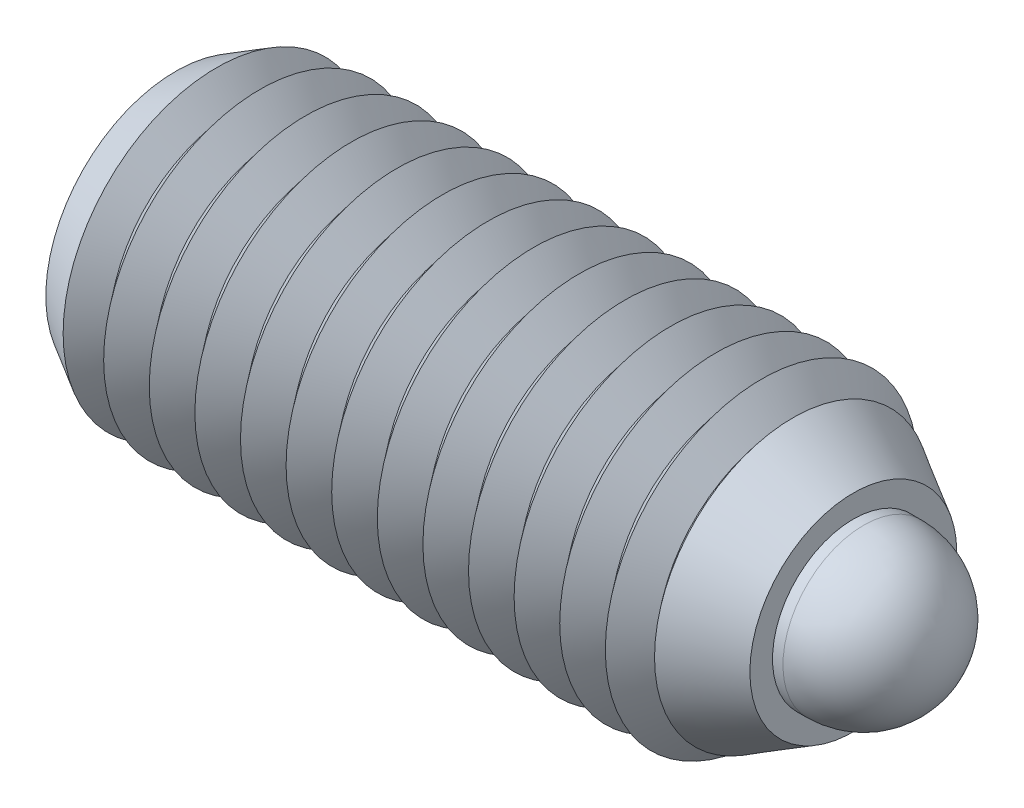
ISO-10303-21;
HEADER;
FILE_DESCRIPTION(('STEP AP214'),'2;1');
FILE_NAME('part.step','',(''),(''),'','','');
FILE_SCHEMA(('AUTOMOTIVE_DESIGN { 1 0 10303 214 1 1 1 1 }'));
ENDSEC;
DATA;
#1=APPLICATION_CONTEXT('core data for automotive mechanical design processes');
#2=APPLICATION_PROTOCOL_DEFINITION('international standard','automotive_design',2000,#1);
#3=PRODUCT_CONTEXT('',#1,'mechanical');
#4=PRODUCT('Part','Part','',(#3));
#5=PRODUCT_RELATED_PRODUCT_CATEGORY('part','',(#4));
#6=PRODUCT_DEFINITION_FORMATION('','',#4);
#7=PRODUCT_DEFINITION_CONTEXT('part definition',#1,'design');
#8=PRODUCT_DEFINITION('design','',#6,#7);
#9=PRODUCT_DEFINITION_SHAPE('','',#8);
#10=(LENGTH_UNIT() NAMED_UNIT(*) SI_UNIT(.MILLI.,.METRE.));
#11=(NAMED_UNIT(*) PLANE_ANGLE_UNIT() SI_UNIT($,.RADIAN.));
#12=(NAMED_UNIT(*) SI_UNIT($,.STERADIAN.) SOLID_ANGLE_UNIT());
#13=UNCERTAINTY_MEASURE_WITH_UNIT(LENGTH_MEASURE(1.E-05),#10,'distance_accuracy_value','');
#14=(GEOMETRIC_REPRESENTATION_CONTEXT(3) GLOBAL_UNCERTAINTY_ASSIGNED_CONTEXT((#13)) GLOBAL_UNIT_ASSIGNED_CONTEXT((#10,
#11,#12)) REPRESENTATION_CONTEXT('',''));
#15=CARTESIAN_POINT('',(0.,0.,0.));
#16=DIRECTION('',(0.,0.,1.));
#17=DIRECTION('',(1.,0.,0.));
#18=AXIS2_PLACEMENT_3D('',#15,#16,#17);
#19=CARTESIAN_POINT('',(23.6,0.,0.));
#20=DIRECTION('',(-1.,0.,0.));
#21=DIRECTION('',(0.,0.,1.));
#22=AXIS2_PLACEMENT_3D('',#19,#20,#21);
#23=CYLINDRICAL_SURFACE('',#22,4.34);
#24=CARTESIAN_POINT('',(19.72,0.,0.));
#25=DIRECTION('',(1.,0.,0.));
#26=DIRECTION('',(0.,0.,-1.));
#27=AXIS2_PLACEMENT_3D('',#24,#25,#26);
#28=CIRCLE('',#27,4.34);
#29=CARTESIAN_POINT('',(19.72,0.,-4.34));
#30=VERTEX_POINT('',#29);
#31=EDGE_CURVE('P0_E21',#30,#30,#28,.T.);
#32=ORIENTED_EDGE('',*,*,#31,.T.);
#33=EDGE_LOOP('',(#32));
#34=FACE_BOUND('',#33,.T.);
#35=CARTESIAN_POINT('',(22.36,0.,0.));
#36=DIRECTION('',(1.,0.,0.));
#37=DIRECTION('',(0.,0.,-1.));
#38=AXIS2_PLACEMENT_3D('',#35,#36,#37);
#39=CIRCLE('',#38,4.34);
#40=CARTESIAN_POINT('',(22.36,0.,-4.34));
#41=VERTEX_POINT('',#40);
#42=EDGE_CURVE('P0_E25',#41,#41,#39,.F.);
#43=ORIENTED_EDGE('',*,*,#42,.T.);
#44=EDGE_LOOP('',(#43));
#45=FACE_BOUND('',#44,.T.);
#46=ADVANCED_FACE('P0_F14',(#34,#45),#23,.T.);
#47=CARTESIAN_POINT('',(18.4,0.,0.));
#48=DIRECTION('',(1.,0.,0.));
#49=DIRECTION('',(0.,0.,-1.));
#50=AXIS2_PLACEMENT_3D('',#47,#48,#49);
#51=PLANE('',#50);
#52=CARTESIAN_POINT('',(18.4,0.,0.));
#53=DIRECTION('',(1.,0.,0.));
#54=DIRECTION('',(0.,0.,-1.));
#55=AXIS2_PLACEMENT_3D('',#52,#53,#54);
#56=CIRCLE('',#55,3.98630706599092);
#57=CARTESIAN_POINT('',(18.4,0.,-3.98630706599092));
#58=VERTEX_POINT('',#57);
#59=EDGE_CURVE('P0_E10',#58,#58,#56,.F.);
#60=ORIENTED_EDGE('',*,*,#59,.T.);
#61=EDGE_LOOP('',(#60));
#62=FACE_BOUND('',#61,.T.);
#63=ADVANCED_FACE('P0_F43',(#62),#51,.F.);
#64=CARTESIAN_POINT('',(26.4,0.,0.));
#65=DIRECTION('',(-1.,0.,0.));
#66=DIRECTION('',(0.,0.,1.));
#67=AXIS2_PLACEMENT_3D('',#64,#65,#66);
#68=CYLINDRICAL_SURFACE('',#67,3.1);
#69=CARTESIAN_POINT('',(26.4,0.,0.));
#70=DIRECTION('',(1.,0.,0.));
#71=DIRECTION('',(0.,0.,-1.));
#72=AXIS2_PLACEMENT_3D('',#69,#70,#71);
#73=CIRCLE('',#72,3.1);
#74=CARTESIAN_POINT('',(26.4,0.,-3.1));
#75=VERTEX_POINT('',#74);
#76=EDGE_CURVE('P0_E29',#75,#75,#73,.T.);
#77=ORIENTED_EDGE('',*,*,#76,.F.);
#78=EDGE_LOOP('',(#77));
#79=FACE_BOUND('',#78,.T.);
#80=CARTESIAN_POINT('',(23.6,0.,0.));
#81=DIRECTION('',(1.,0.,0.));
#82=DIRECTION('',(0.,0.,-1.));
#83=AXIS2_PLACEMENT_3D('',#80,#81,#82);
#84=CIRCLE('',#83,3.1);
#85=CARTESIAN_POINT('',(23.6,0.,-3.1));
#86=VERTEX_POINT('',#85);
#87=EDGE_CURVE('P0_E32',#86,#86,#84,.T.);
#88=ORIENTED_EDGE('',*,*,#87,.T.);
#89=EDGE_LOOP('',(#88));
#90=FACE_BOUND('',#89,.T.);
#91=ADVANCED_FACE('P0_F40',(#79,#90),#68,.T.);
#92=CARTESIAN_POINT('',(26.4,0.,0.));
#93=DIRECTION('',(-1.,0.,0.));
#94=DIRECTION('',(0.,1.,0.));
#95=AXIS2_PLACEMENT_3D('',#92,#93,#94);
#96=SPHERICAL_SURFACE('',#95,3.1);
#97=ORIENTED_EDGE('',*,*,#76,.T.);
#98=EDGE_LOOP('',(#97));
#99=FACE_BOUND('',#98,.T.);
#100=ADVANCED_FACE('P0_F38',(#99),#96,.T.);
#101=CARTESIAN_POINT('',(23.6,0.,0.));
#102=DIRECTION('',(-1.,0.,0.));
#103=DIRECTION('',(0.,0.,1.));
#104=AXIS2_PLACEMENT_3D('',#101,#102,#103);
#105=CONICAL_SURFACE('',#104,3.10000000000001,0.785398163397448);
#106=ORIENTED_EDGE('',*,*,#42,.F.);
#107=EDGE_LOOP('',(#106));
#108=FACE_BOUND('',#107,.T.);
#109=ORIENTED_EDGE('',*,*,#87,.F.);
#110=EDGE_LOOP('',(#109));
#111=FACE_BOUND('',#110,.T.);
#112=ADVANCED_FACE('P0_F47',(#108,#111),#105,.T.);
#113=CARTESIAN_POINT('',(19.72,0.,0.));
#114=DIRECTION('',(1.,0.,0.));
#115=DIRECTION('',(0.,0.,-1.));
#116=AXIS2_PLACEMENT_3D('',#113,#114,#115);
#117=CONICAL_SURFACE('',#116,4.34,0.261799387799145);
#118=CARTESIAN_POINT('',(18.4,0.,-3.98630706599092));
#119=CARTESIAN_POINT('',(18.41375,0.,-3.98999136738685));
#120=CARTESIAN_POINT('',(18.4275,0.,-3.99367566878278));
#121=CARTESIAN_POINT('',(18.455,0.,-4.00104427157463));
#122=CARTESIAN_POINT('',(18.46875,0.,-4.00472857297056));
#123=CARTESIAN_POINT('',(18.49625,0.,-4.01209717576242));
#124=CARTESIAN_POINT('',(18.51,0.,-4.01578147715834));
#125=CARTESIAN_POINT('',(18.5375,0.,-4.0231500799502));
#126=CARTESIAN_POINT('',(18.55125,0.,-4.02683438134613));
#127=CARTESIAN_POINT('',(18.57875,0.,-4.03420298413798));
#128=CARTESIAN_POINT('',(18.5925,0.,-4.03788728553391));
#129=CARTESIAN_POINT('',(18.62,0.,-4.04525588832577));
#130=CARTESIAN_POINT('',(18.63375,0.,-4.0489401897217));
#131=CARTESIAN_POINT('',(18.66125,0.,-4.05630879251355));
#132=CARTESIAN_POINT('',(18.675,0.,-4.05999309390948));
#133=CARTESIAN_POINT('',(18.7025,0.,-4.06736169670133));
#134=CARTESIAN_POINT('',(18.71625,0.,-4.07104599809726));
#135=CARTESIAN_POINT('',(18.74375,0.,-4.07841460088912));
#136=CARTESIAN_POINT('',(18.7575,0.,-4.08209890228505));
#137=CARTESIAN_POINT('',(18.785,0.,-4.0894675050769));
#138=CARTESIAN_POINT('',(18.79875,0.,-4.09315180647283));
#139=CARTESIAN_POINT('',(18.82625,0.,-4.10052040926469));
#140=CARTESIAN_POINT('',(18.84,0.,-4.10420471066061));
#141=CARTESIAN_POINT('',(18.8675,0.,-4.11157331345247));
#142=CARTESIAN_POINT('',(18.88125,0.,-4.1152576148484));
#143=CARTESIAN_POINT('',(18.90875,0.,-4.12262621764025));
#144=CARTESIAN_POINT('',(18.9225,0.,-4.12631051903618));
#145=CARTESIAN_POINT('',(18.95,0.,-4.13367912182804));
#146=CARTESIAN_POINT('',(18.96375,0.,-4.13736342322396));
#147=CARTESIAN_POINT('',(18.99125,0.,-4.14473202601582));
#148=CARTESIAN_POINT('',(19.005,0.,-4.14841632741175));
#149=CARTESIAN_POINT('',(19.0325,0.,-4.1557849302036));
#150=CARTESIAN_POINT('',(19.04625,0.,-4.15946923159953));
#151=CARTESIAN_POINT('',(19.07375,0.,-4.16683783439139));
#152=CARTESIAN_POINT('',(19.0875,0.,-4.17052213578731));
#153=CARTESIAN_POINT('',(19.115,0.,-4.17789073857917));
#154=CARTESIAN_POINT('',(19.12875,0.,-4.1815750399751));
#155=CARTESIAN_POINT('',(19.15625,0.,-4.18894364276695));
#156=CARTESIAN_POINT('',(19.17,0.,-4.19262794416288));
#157=CARTESIAN_POINT('',(19.1975,0.,-4.19999654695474));
#158=CARTESIAN_POINT('',(19.21125,0.,-4.20368084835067));
#159=CARTESIAN_POINT('',(19.23875,0.,-4.21104945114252));
#160=CARTESIAN_POINT('',(19.2525,0.,-4.21473375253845));
#161=CARTESIAN_POINT('',(19.28,0.,-4.22210235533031));
#162=CARTESIAN_POINT('',(19.29375,0.,-4.22578665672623));
#163=CARTESIAN_POINT('',(19.32125,0.,-4.23315525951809));
#164=CARTESIAN_POINT('',(19.335,0.,-4.23683956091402));
#165=CARTESIAN_POINT('',(19.3625,0.,-4.24420816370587));
#166=CARTESIAN_POINT('',(19.37625,0.,-4.2478924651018));
#167=CARTESIAN_POINT('',(19.40375,0.,-4.25526106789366));
#168=CARTESIAN_POINT('',(19.4175,0.,-4.25894536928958));
#169=CARTESIAN_POINT('',(19.445,0.,-4.26631397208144));
#170=CARTESIAN_POINT('',(19.45875,0.,-4.26999827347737));
#171=CARTESIAN_POINT('',(19.48625,0.,-4.27736687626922));
#172=CARTESIAN_POINT('',(19.5,0.,-4.28105117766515));
#173=CARTESIAN_POINT('',(19.5275,0.,-4.28841978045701));
#174=CARTESIAN_POINT('',(19.54125,0.,-4.29210408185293));
#175=CARTESIAN_POINT('',(19.56875,0.,-4.29947268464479));
#176=CARTESIAN_POINT('',(19.5825,0.,-4.30315698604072));
#177=CARTESIAN_POINT('',(19.61,0.,-4.31052558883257));
#178=CARTESIAN_POINT('',(19.62375,0.,-4.3142098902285));
#179=CARTESIAN_POINT('',(19.65125,0.,-4.32157849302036));
#180=CARTESIAN_POINT('',(19.665,0.,-4.32526279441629));
#181=CARTESIAN_POINT('',(19.6925,0.,-4.33263139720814));
#182=CARTESIAN_POINT('',(19.70625,0.,-4.33631569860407));
#183=CARTESIAN_POINT('',(19.72,0.,-4.34));
#184=B_SPLINE_CURVE_WITH_KNOTS('',3,(#118,#119,#120,#121,#122,#123,#124,#125,#126,#127,#128,
#129,#130,#131,#132,#133,#134,#135,#136,#137,#138,#139,#140,#141,#142,#143,#144,#145,#146,#147,
#148,#149,#150,#151,#152,#153,#154,#155,#156,#157,#158,#159,#160,#161,#162,#163,#164,#165,#166,
#167,#168,#169,#170,#171,#172,#173,#174,#175,#176,#177,#178,#179,#180,#181,#182,#183),
.UNSPECIFIED.,.F.,.F.,(4,2,2,2,2,2,2,2,2,2,2,2,2,2,2,2,2,2,2,2,2,2,2,2,2,2,2,2,2,2,2,2,4),(0.,
0.0427051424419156,0.0854102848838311,0.128115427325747,0.170820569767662,0.213525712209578,
0.256230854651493,0.298935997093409,0.341641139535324,0.38434628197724,0.427051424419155,
0.469756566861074,0.51246170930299,0.555166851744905,0.597871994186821,0.640577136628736,
0.683282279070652,0.725987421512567,0.768692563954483,0.811397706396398,0.854102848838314,
0.896807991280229,0.939513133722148,0.982218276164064,1.02492341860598,1.06762856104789,
1.11033370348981,1.15303884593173,1.19574398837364,1.23844913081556,1.28115427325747,
1.32385941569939,1.36656455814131),.UNSPECIFIED.);
#185=EDGE_CURVE('P0_BSEAM16',#58,#30,#184,.T.);
#186=ORIENTED_EDGE('',*,*,#59,.F.);
#187=ORIENTED_EDGE('',*,*,#31,.F.);
#188=ORIENTED_EDGE('',*,*,#185,.T.);
#189=ORIENTED_EDGE('',*,*,#185,.F.);
#190=EDGE_LOOP('',(#186,#188,#187,#189));
#191=FACE_BOUND('',#190,.T.);
#192=ADVANCED_FACE('P0_F16',(#191),#117,.T.);
#193=CLOSED_SHELL('',(#46,#63,#91,#100,#112,#192));
#194=MANIFOLD_SOLID_BREP('P0_B1',#193);
#195=CARTESIAN_POINT('',(26.,0.,0.));
#196=DIRECTION('',(-1.,0.,0.));
#197=DIRECTION('',(0.,0.,1.));
#198=AXIS2_PLACEMENT_3D('',#195,#196,#197);
#199=CONICAL_SURFACE('',#198,3.96999999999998,0.5235987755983);
#200=CARTESIAN_POINT('',(26.,0.,0.));
#201=DIRECTION('',(1.,0.,0.));
#202=DIRECTION('',(0.,0.,-1.));
#203=AXIS2_PLACEMENT_3D('',#200,#201,#202);
#204=CIRCLE('',#203,3.96999999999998);
#205=CARTESIAN_POINT('',(26.,0.,3.96999999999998));
#206=VERTEX_POINT('',#205);
#207=EDGE_CURVE('P1_E326',#206,#206,#204,.T.);
#208=CARTESIAN_POINT('',(23.6807225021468,0.,0.));
#209=DIRECTION('',(1.,0.,0.));
#210=DIRECTION('',(0.,0.,-1.));
#211=AXIS2_PLACEMENT_3D('',#208,#209,#210);
#212=CIRCLE('',#211,5.30903548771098);
#213=CARTESIAN_POINT('',(23.6807225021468,0.,5.30903548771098));
#214=VERTEX_POINT('',#213);
#215=EDGE_CURVE('P1_E330',#214,#214,#212,.T.);
#216=CARTESIAN_POINT('',(26.,0.,3.96999999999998));
#217=CARTESIAN_POINT('',(25.9758408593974,0.,3.9839482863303));
#218=CARTESIAN_POINT('',(25.9516817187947,0.,3.99789657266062));
#219=CARTESIAN_POINT('',(25.9033634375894,0.,4.02579314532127));
#220=CARTESIAN_POINT('',(25.8792042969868,0.,4.03974143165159));
#221=CARTESIAN_POINT('',(25.8308860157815,0.,4.06763800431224));
#222=CARTESIAN_POINT('',(25.8067268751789,0.,4.08158629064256));
#223=CARTESIAN_POINT('',(25.7584085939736,0.,4.10948286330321));
#224=CARTESIAN_POINT('',(25.734249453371,0.,4.12343114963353));
#225=CARTESIAN_POINT('',(25.6859311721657,0.,4.15132772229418));
#226=CARTESIAN_POINT('',(25.6617720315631,0.,4.1652760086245));
#227=CARTESIAN_POINT('',(25.6134537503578,0.,4.19317258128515));
#228=CARTESIAN_POINT('',(25.5892946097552,0.,4.20712086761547));
#229=CARTESIAN_POINT('',(25.5409763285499,0.,4.23501744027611));
#230=CARTESIAN_POINT('',(25.5168171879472,0.,4.24896572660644));
#231=CARTESIAN_POINT('',(25.468498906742,0.,4.27686229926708));
#232=CARTESIAN_POINT('',(25.4443397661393,0.,4.29081058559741));
#233=CARTESIAN_POINT('',(25.3960214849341,0.,4.31870715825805));
#234=CARTESIAN_POINT('',(25.3718623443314,0.,4.33265544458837));
#235=CARTESIAN_POINT('',(25.3235440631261,0.,4.36055201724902));
#236=CARTESIAN_POINT('',(25.2993849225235,0.,4.37450030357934));
#237=CARTESIAN_POINT('',(25.2510666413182,0.,4.40239687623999));
#238=CARTESIAN_POINT('',(25.2269075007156,0.,4.41634516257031));
#239=CARTESIAN_POINT('',(25.1785892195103,0.,4.44424173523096));
#240=CARTESIAN_POINT('',(25.1544300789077,0.,4.45819002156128));
#241=CARTESIAN_POINT('',(25.1061117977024,0.,4.48608659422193));
#242=CARTESIAN_POINT('',(25.0819526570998,0.,4.50003488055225));
#243=CARTESIAN_POINT('',(25.0336343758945,0.,4.5279314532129));
#244=CARTESIAN_POINT('',(25.0094752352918,0.,4.54187973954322));
#245=CARTESIAN_POINT('',(24.9611569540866,0.,4.56977631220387));
#246=CARTESIAN_POINT('',(24.9369978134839,0.,4.58372459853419));
#247=CARTESIAN_POINT('',(24.8886795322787,0.,4.61162117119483));
#248=CARTESIAN_POINT('',(24.864520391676,0.,4.62556945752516));
#249=CARTESIAN_POINT('',(24.8162021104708,0.,4.6534660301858));
#250=CARTESIAN_POINT('',(24.7920429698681,0.,4.66741431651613));
#251=CARTESIAN_POINT('',(24.7437246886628,0.,4.69531088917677));
#252=CARTESIAN_POINT('',(24.7195655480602,0.,4.70925917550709));
#253=CARTESIAN_POINT('',(24.6712472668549,0.,4.73715574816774));
#254=CARTESIAN_POINT('',(24.6470881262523,0.,4.75110403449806));
#255=CARTESIAN_POINT('',(24.598769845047,0.,4.77900060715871));
#256=CARTESIAN_POINT('',(24.5746107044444,0.,4.79294889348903));
#257=CARTESIAN_POINT('',(24.5262924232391,0.,4.82084546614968));
#258=CARTESIAN_POINT('',(24.5021332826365,0.,4.83479375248));
#259=CARTESIAN_POINT('',(24.4538150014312,0.,4.86269032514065));
#260=CARTESIAN_POINT('',(24.4296558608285,0.,4.87663861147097));
#261=CARTESIAN_POINT('',(24.3813375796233,0.,4.90453518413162));
#262=CARTESIAN_POINT('',(24.3571784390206,0.,4.91848347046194));
#263=CARTESIAN_POINT('',(24.3088601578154,0.,4.94638004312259));
#264=CARTESIAN_POINT('',(24.2847010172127,0.,4.96032832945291));
#265=CARTESIAN_POINT('',(24.2363827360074,0.,4.98822490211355));
#266=CARTESIAN_POINT('',(24.2122235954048,0.,5.00217318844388));
#267=CARTESIAN_POINT('',(24.1639053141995,0.,5.03006976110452));
#268=CARTESIAN_POINT('',(24.1397461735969,0.,5.04401804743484));
#269=CARTESIAN_POINT('',(24.0914278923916,0.,5.07191462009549));
#270=CARTESIAN_POINT('',(24.067268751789,0.,5.08586290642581));
#271=CARTESIAN_POINT('',(24.0189504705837,0.,5.11375947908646));
#272=CARTESIAN_POINT('',(23.9947913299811,0.,5.12770776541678));
#273=CARTESIAN_POINT('',(23.9464730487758,0.,5.15560433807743));
#274=CARTESIAN_POINT('',(23.9223139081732,0.,5.16955262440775));
#275=CARTESIAN_POINT('',(23.8739956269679,0.,5.1974491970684));
#276=CARTESIAN_POINT('',(23.8498364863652,0.,5.21139748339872));
#277=CARTESIAN_POINT('',(23.80151820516,0.,5.23929405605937));
#278=CARTESIAN_POINT('',(23.7773590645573,0.,5.25324234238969));
#279=CARTESIAN_POINT('',(23.7290407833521,0.,5.28113891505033));
#280=CARTESIAN_POINT('',(23.7048816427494,0.,5.29508720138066));
#281=CARTESIAN_POINT('',(23.6807225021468,0.,5.30903548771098));
#282=B_SPLINE_CURVE_WITH_KNOTS('',3,(#216,#217,#218,#219,#220,#221,#222,#223,#224,#225,#226,
#227,#228,#229,#230,#231,#232,#233,#234,#235,#236,#237,#238,#239,#240,#241,#242,#243,#244,#245,
#246,#247,#248,#249,#250,#251,#252,#253,#254,#255,#256,#257,#258,#259,#260,#261,#262,#263,#264,
#265,#266,#267,#268,#269,#270,#271,#272,#273,#274,#275,#276,#277,#278,#279,#280,#281),
.UNSPECIFIED.,.F.,.F.,(4,2,2,2,2,2,2,2,2,2,2,2,2,2,2,2,2,2,2,2,2,2,2,2,2,2,2,2,2,2,2,2,4),(0.,
0.0836897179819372,0.167379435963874,0.251069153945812,0.334758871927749,0.418448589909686,
0.502138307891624,0.585828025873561,0.669517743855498,0.753207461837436,0.836897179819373,
0.920586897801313,1.00427661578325,1.08796633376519,1.17165605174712,1.25534576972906,
1.339035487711,1.42272520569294,1.50641492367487,1.59010464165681,1.67379435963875,
1.75748407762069,1.84117379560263,1.92486351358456,2.0085532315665,2.09224294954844,
2.17593266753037,2.25962238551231,2.34331210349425,2.42700182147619,2.51069153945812,
2.59438125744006,2.678070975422),.UNSPECIFIED.);
#283=EDGE_CURVE('P1_BSEAM15',#206,#214,#282,.T.);
#284=ORIENTED_EDGE('',*,*,#207,.F.);
#285=ORIENTED_EDGE('',*,*,#215,.T.);
#286=ORIENTED_EDGE('',*,*,#283,.T.);
#287=ORIENTED_EDGE('',*,*,#283,.F.);
#288=EDGE_LOOP('',(#284,#286,#285,#287));
#289=FACE_BOUND('',#288,.T.);
#290=ADVANCED_FACE('P1_F15',(#289),#199,.T.);
#291=CARTESIAN_POINT('',(26.,0.,0.));
#292=DIRECTION('',(1.,0.,0.));
#293=DIRECTION('',(0.,0.,-1.));
#294=AXIS2_PLACEMENT_3D('',#291,#292,#293);
#295=PLANE('',#294);
#296=ORIENTED_EDGE('',*,*,#207,.T.);
#297=EDGE_LOOP('',(#296));
#298=FACE_BOUND('',#297,.T.);
#299=CARTESIAN_POINT('',(26.,0.,0.));
#300=DIRECTION('',(1.,0.,0.));
#301=DIRECTION('',(0.,0.,-1.));
#302=AXIS2_PLACEMENT_3D('',#299,#300,#301);
#303=CIRCLE('',#302,3.1);
#304=CARTESIAN_POINT('',(26.,0.,-3.1));
#305=VERTEX_POINT('',#304);
#306=EDGE_CURVE('P1_E333',#305,#305,#303,.T.);
#307=ORIENTED_EDGE('',*,*,#306,.F.);
#308=EDGE_LOOP('',(#307));
#309=FACE_BOUND('',#308,.T.);
#310=ADVANCED_FACE('P1_F188',(#298,#309),#295,.T.);
#311=CARTESIAN_POINT('',(7.8,0.,0.));
#312=DIRECTION('',(-1.,0.,0.));
#313=DIRECTION('',(0.,0.,1.));
#314=AXIS2_PLACEMENT_3D('',#311,#312,#313);
#315=PLANE('',#314);
#316=CARTESIAN_POINT('',(7.8,0.,0.));
#317=DIRECTION('',(1.,0.,0.));
#318=DIRECTION('',(0.,0.,-1.));
#319=AXIS2_PLACEMENT_3D('',#316,#317,#318);
#320=CIRCLE('',#319,4.34);
#321=CARTESIAN_POINT('',(7.8,0.,-4.34));
#322=VERTEX_POINT('',#321);
#323=EDGE_CURVE('P1_E416',#322,#322,#320,.T.);
#324=ORIENTED_EDGE('',*,*,#323,.T.);
#325=EDGE_LOOP('',(#324));
#326=FACE_BOUND('',#325,.T.);
#327=ADVANCED_FACE('P1_F194',(#326),#315,.F.);
#328=CARTESIAN_POINT('',(26.,0.,0.));
#329=DIRECTION('',(1.,0.,0.));
#330=DIRECTION('',(0.,0.,-1.));
#331=AXIS2_PLACEMENT_3D('',#328,#329,#330);
#332=CYLINDRICAL_SURFACE('',#331,4.34);
#333=ORIENTED_EDGE('',*,*,#323,.F.);
#334=EDGE_LOOP('',(#333));
#335=FACE_BOUND('',#334,.T.);
#336=CARTESIAN_POINT('',(21.7,0.,0.));
#337=DIRECTION('',(1.,0.,0.));
#338=DIRECTION('',(0.,0.,-1.));
#339=AXIS2_PLACEMENT_3D('',#336,#337,#338);
#340=CIRCLE('',#339,4.34);
#341=CARTESIAN_POINT('',(21.7,0.,-4.34));
#342=VERTEX_POINT('',#341);
#343=EDGE_CURVE('P1_E414',#342,#342,#340,.T.);
#344=ORIENTED_EDGE('',*,*,#343,.T.);
#345=EDGE_LOOP('',(#344));
#346=FACE_BOUND('',#345,.T.);
#347=ADVANCED_FACE('P1_F458',(#335,#346),#332,.F.);
#348=CARTESIAN_POINT('',(26.,0.,0.));
#349=DIRECTION('',(-1.,0.,0.));
#350=DIRECTION('',(0.,0.,1.));
#351=AXIS2_PLACEMENT_3D('',#348,#349,#350);
#352=CONICAL_SURFACE('',#351,3.1,0.280755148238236);
#353=ORIENTED_EDGE('',*,*,#343,.F.);
#354=EDGE_LOOP('',(#353));
#355=FACE_BOUND('',#354,.T.);
#356=ORIENTED_EDGE('',*,*,#306,.T.);
#357=EDGE_LOOP('',(#356));
#358=FACE_BOUND('',#357,.T.);
#359=ADVANCED_FACE('P1_F464',(#355,#358),#352,.F.);
#360=CARTESIAN_POINT('',(23.3589368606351,0.,0.));
#361=DIRECTION('',(1.,0.,0.));
#362=DIRECTION('',(0.,0.,-1.));
#363=AXIS2_PLACEMENT_3D('',#360,#361,#362);
#364=CONICAL_SURFACE('',#363,4.90712535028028,0.895664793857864);
#365=ORIENTED_EDGE('',*,*,#215,.F.);
#366=EDGE_LOOP('',(#365));
#367=FACE_BOUND('',#366,.T.);
#368=CARTESIAN_POINT('',(23.3589368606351,0.,0.));
#369=DIRECTION('',(-1.,0.,0.));
#370=DIRECTION('',(0.,0.,1.));
#371=AXIS2_PLACEMENT_3D('',#368,#369,#370);
#372=CIRCLE('',#371,4.90712535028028);
#373=CARTESIAN_POINT('',(23.3589368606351,0.,4.90712535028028));
#374=VERTEX_POINT('',#373);
#375=EDGE_CURVE('P1_E334',#374,#374,#372,.T.);
#376=ORIENTED_EDGE('',*,*,#375,.F.);
#377=EDGE_LOOP('',(#376));
#378=FACE_BOUND('',#377,.T.);
#379=ADVANCED_FACE('P1_F469',(#367,#378),#364,.T.);
#380=CARTESIAN_POINT('',(22.4839368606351,0.,0.));
#381=DIRECTION('',(-1.,0.,0.));
#382=DIRECTION('',(0.,0.,1.));
#383=AXIS2_PLACEMENT_3D('',#380,#381,#382);
#384=CONICAL_SURFACE('',#383,6.,0.895664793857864);
#385=ORIENTED_EDGE('',*,*,#375,.T.);
#386=EDGE_LOOP('',(#385));
#387=FACE_BOUND('',#386,.T.);
#388=CARTESIAN_POINT('',(22.4839368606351,0.,0.));
#389=DIRECTION('',(-1.,0.,0.));
#390=DIRECTION('',(0.,0.,1.));
#391=AXIS2_PLACEMENT_3D('',#388,#389,#390);
#392=CIRCLE('',#391,6.);
#393=CARTESIAN_POINT('',(22.4839368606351,0.,6.));
#394=VERTEX_POINT('',#393);
#395=EDGE_CURVE('P1_E407',#394,#394,#392,.T.);
#396=ORIENTED_EDGE('',*,*,#395,.F.);
#397=EDGE_LOOP('',(#396));
#398=FACE_BOUND('',#397,.T.);
#399=ADVANCED_FACE('P1_F473',(#387,#398),#384,.T.);
#400=CARTESIAN_POINT('',(21.6089368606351,0.,0.));
#401=DIRECTION('',(1.,0.,0.));
#402=DIRECTION('',(0.,0.,-1.));
#403=AXIS2_PLACEMENT_3D('',#400,#401,#402);
#404=CONICAL_SURFACE('',#403,4.90712535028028,0.895664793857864);
#405=ORIENTED_EDGE('',*,*,#395,.T.);
#406=EDGE_LOOP('',(#405));
#407=FACE_BOUND('',#406,.T.);
#408=CARTESIAN_POINT('',(21.6089368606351,0.,0.));
#409=DIRECTION('',(-1.,0.,0.));
#410=DIRECTION('',(0.,0.,1.));
#411=AXIS2_PLACEMENT_3D('',#408,#409,#410);
#412=CIRCLE('',#411,4.90712535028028);
#413=CARTESIAN_POINT('',(21.6089368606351,0.,4.90712535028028));
#414=VERTEX_POINT('',#413);
#415=EDGE_CURVE('P1_E404',#414,#414,#412,.T.);
#416=ORIENTED_EDGE('',*,*,#415,.F.);
#417=EDGE_LOOP('',(#416));
#418=FACE_BOUND('',#417,.T.);
#419=ADVANCED_FACE('P1_F702',(#407,#418),#404,.T.);
#420=CARTESIAN_POINT('',(20.7339368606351,0.,0.));
#421=DIRECTION('',(-1.,0.,0.));
#422=DIRECTION('',(0.,0.,1.));
#423=AXIS2_PLACEMENT_3D('',#420,#421,#422);
#424=CONICAL_SURFACE('',#423,6.,0.895664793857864);
#425=ORIENTED_EDGE('',*,*,#415,.T.);
#426=EDGE_LOOP('',(#425));
#427=FACE_BOUND('',#426,.T.);
#428=CARTESIAN_POINT('',(20.7339368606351,0.,0.));
#429=DIRECTION('',(-1.,0.,0.));
#430=DIRECTION('',(0.,0.,1.));
#431=AXIS2_PLACEMENT_3D('',#428,#429,#430);
#432=CIRCLE('',#431,6.);
#433=CARTESIAN_POINT('',(20.7339368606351,0.,6.));
#434=VERTEX_POINT('',#433);
#435=EDGE_CURVE('P1_E401',#434,#434,#432,.T.);
#436=ORIENTED_EDGE('',*,*,#435,.F.);
#437=EDGE_LOOP('',(#436));
#438=FACE_BOUND('',#437,.T.);
#439=ADVANCED_FACE('P1_F694',(#427,#438),#424,.T.);
#440=CARTESIAN_POINT('',(19.8589368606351,0.,0.));
#441=DIRECTION('',(1.,0.,0.));
#442=DIRECTION('',(0.,0.,-1.));
#443=AXIS2_PLACEMENT_3D('',#440,#441,#442);
#444=CONICAL_SURFACE('',#443,4.90712535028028,0.895664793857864);
#445=ORIENTED_EDGE('',*,*,#435,.T.);
#446=EDGE_LOOP('',(#445));
#447=FACE_BOUND('',#446,.T.);
#448=CARTESIAN_POINT('',(19.8589368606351,0.,0.));
#449=DIRECTION('',(-1.,0.,0.));
#450=DIRECTION('',(0.,0.,1.));
#451=AXIS2_PLACEMENT_3D('',#448,#449,#450);
#452=CIRCLE('',#451,4.90712535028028);
#453=CARTESIAN_POINT('',(19.8589368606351,0.,4.90712535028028));
#454=VERTEX_POINT('',#453);
#455=EDGE_CURVE('P1_E398',#454,#454,#452,.T.);
#456=ORIENTED_EDGE('',*,*,#455,.F.);
#457=EDGE_LOOP('',(#456));
#458=FACE_BOUND('',#457,.T.);
#459=ADVANCED_FACE('P1_F686',(#447,#458),#444,.T.);
#460=CARTESIAN_POINT('',(18.9839368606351,0.,0.));
#461=DIRECTION('',(-1.,0.,0.));
#462=DIRECTION('',(0.,0.,1.));
#463=AXIS2_PLACEMENT_3D('',#460,#461,#462);
#464=CONICAL_SURFACE('',#463,6.,0.895664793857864);
#465=ORIENTED_EDGE('',*,*,#455,.T.);
#466=EDGE_LOOP('',(#465));
#467=FACE_BOUND('',#466,.T.);
#468=CARTESIAN_POINT('',(18.9839368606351,0.,0.));
#469=DIRECTION('',(-1.,0.,0.));
#470=DIRECTION('',(0.,0.,1.));
#471=AXIS2_PLACEMENT_3D('',#468,#469,#470);
#472=CIRCLE('',#471,6.);
#473=CARTESIAN_POINT('',(18.9839368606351,0.,6.));
#474=VERTEX_POINT('',#473);
#475=EDGE_CURVE('P1_E395',#474,#474,#472,.T.);
#476=ORIENTED_EDGE('',*,*,#475,.F.);
#477=EDGE_LOOP('',(#476));
#478=FACE_BOUND('',#477,.T.);
#479=ADVANCED_FACE('P1_F678',(#467,#478),#464,.T.);
#480=CARTESIAN_POINT('',(18.1089368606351,0.,0.));
#481=DIRECTION('',(1.,0.,0.));
#482=DIRECTION('',(0.,0.,-1.));
#483=AXIS2_PLACEMENT_3D('',#480,#481,#482);
#484=CONICAL_SURFACE('',#483,4.90712535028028,0.895664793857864);
#485=ORIENTED_EDGE('',*,*,#475,.T.);
#486=EDGE_LOOP('',(#485));
#487=FACE_BOUND('',#486,.T.);
#488=CARTESIAN_POINT('',(18.1089368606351,0.,0.));
#489=DIRECTION('',(-1.,0.,0.));
#490=DIRECTION('',(0.,0.,1.));
#491=AXIS2_PLACEMENT_3D('',#488,#489,#490);
#492=CIRCLE('',#491,4.90712535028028);
#493=CARTESIAN_POINT('',(18.1089368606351,0.,4.90712535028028));
#494=VERTEX_POINT('',#493);
#495=EDGE_CURVE('P1_E392',#494,#494,#492,.T.);
#496=ORIENTED_EDGE('',*,*,#495,.F.);
#497=EDGE_LOOP('',(#496));
#498=FACE_BOUND('',#497,.T.);
#499=ADVANCED_FACE('P1_F670',(#487,#498),#484,.T.);
#500=CARTESIAN_POINT('',(17.2339368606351,0.,0.));
#501=DIRECTION('',(-1.,0.,0.));
#502=DIRECTION('',(0.,0.,1.));
#503=AXIS2_PLACEMENT_3D('',#500,#501,#502);
#504=CONICAL_SURFACE('',#503,6.,0.895664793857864);
#505=ORIENTED_EDGE('',*,*,#495,.T.);
#506=EDGE_LOOP('',(#505));
#507=FACE_BOUND('',#506,.T.);
#508=CARTESIAN_POINT('',(17.2339368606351,0.,0.));
#509=DIRECTION('',(-1.,0.,0.));
#510=DIRECTION('',(0.,0.,1.));
#511=AXIS2_PLACEMENT_3D('',#508,#509,#510);
#512=CIRCLE('',#511,6.);
#513=CARTESIAN_POINT('',(17.2339368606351,0.,6.));
#514=VERTEX_POINT('',#513);
#515=EDGE_CURVE('P1_E389',#514,#514,#512,.T.);
#516=ORIENTED_EDGE('',*,*,#515,.F.);
#517=EDGE_LOOP('',(#516));
#518=FACE_BOUND('',#517,.T.);
#519=ADVANCED_FACE('P1_F662',(#507,#518),#504,.T.);
#520=CARTESIAN_POINT('',(16.3589368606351,0.,0.));
#521=DIRECTION('',(1.,0.,0.));
#522=DIRECTION('',(0.,0.,-1.));
#523=AXIS2_PLACEMENT_3D('',#520,#521,#522);
#524=CONICAL_SURFACE('',#523,4.90712535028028,0.895664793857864);
#525=ORIENTED_EDGE('',*,*,#515,.T.);
#526=EDGE_LOOP('',(#525));
#527=FACE_BOUND('',#526,.T.);
#528=CARTESIAN_POINT('',(16.3589368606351,0.,0.));
#529=DIRECTION('',(-1.,0.,0.));
#530=DIRECTION('',(0.,0.,1.));
#531=AXIS2_PLACEMENT_3D('',#528,#529,#530);
#532=CIRCLE('',#531,4.90712535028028);
#533=CARTESIAN_POINT('',(16.3589368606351,0.,4.90712535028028));
#534=VERTEX_POINT('',#533);
#535=EDGE_CURVE('P1_E386',#534,#534,#532,.T.);
#536=ORIENTED_EDGE('',*,*,#535,.F.);
#537=EDGE_LOOP('',(#536));
#538=FACE_BOUND('',#537,.T.);
#539=ADVANCED_FACE('P1_F654',(#527,#538),#524,.T.);
#540=CARTESIAN_POINT('',(15.4839368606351,0.,0.));
#541=DIRECTION('',(-1.,0.,0.));
#542=DIRECTION('',(0.,0.,1.));
#543=AXIS2_PLACEMENT_3D('',#540,#541,#542);
#544=CONICAL_SURFACE('',#543,6.,0.895664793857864);
#545=ORIENTED_EDGE('',*,*,#535,.T.);
#546=EDGE_LOOP('',(#545));
#547=FACE_BOUND('',#546,.T.);
#548=CARTESIAN_POINT('',(15.4839368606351,0.,0.));
#549=DIRECTION('',(-1.,0.,0.));
#550=DIRECTION('',(0.,0.,1.));
#551=AXIS2_PLACEMENT_3D('',#548,#549,#550);
#552=CIRCLE('',#551,6.);
#553=CARTESIAN_POINT('',(15.4839368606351,0.,6.));
#554=VERTEX_POINT('',#553);
#555=EDGE_CURVE('P1_E383',#554,#554,#552,.T.);
#556=ORIENTED_EDGE('',*,*,#555,.F.);
#557=EDGE_LOOP('',(#556));
#558=FACE_BOUND('',#557,.T.);
#559=ADVANCED_FACE('P1_F646',(#547,#558),#544,.T.);
#560=CARTESIAN_POINT('',(14.6089368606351,0.,0.));
#561=DIRECTION('',(1.,0.,0.));
#562=DIRECTION('',(0.,0.,-1.));
#563=AXIS2_PLACEMENT_3D('',#560,#561,#562);
#564=CONICAL_SURFACE('',#563,4.90712535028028,0.895664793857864);
#565=ORIENTED_EDGE('',*,*,#555,.T.);
#566=EDGE_LOOP('',(#565));
#567=FACE_BOUND('',#566,.T.);
#568=CARTESIAN_POINT('',(14.6089368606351,0.,0.));
#569=DIRECTION('',(-1.,0.,0.));
#570=DIRECTION('',(0.,0.,1.));
#571=AXIS2_PLACEMENT_3D('',#568,#569,#570);
#572=CIRCLE('',#571,4.90712535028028);
#573=CARTESIAN_POINT('',(14.6089368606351,0.,4.90712535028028));
#574=VERTEX_POINT('',#573);
#575=EDGE_CURVE('P1_E380',#574,#574,#572,.T.);
#576=ORIENTED_EDGE('',*,*,#575,.F.);
#577=EDGE_LOOP('',(#576));
#578=FACE_BOUND('',#577,.T.);
#579=ADVANCED_FACE('P1_F638',(#567,#578),#564,.T.);
#580=CARTESIAN_POINT('',(13.7339368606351,0.,0.));
#581=DIRECTION('',(-1.,0.,0.));
#582=DIRECTION('',(0.,0.,1.));
#583=AXIS2_PLACEMENT_3D('',#580,#581,#582);
#584=CONICAL_SURFACE('',#583,6.,0.895664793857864);
#585=ORIENTED_EDGE('',*,*,#575,.T.);
#586=EDGE_LOOP('',(#585));
#587=FACE_BOUND('',#586,.T.);
#588=CARTESIAN_POINT('',(13.7339368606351,0.,0.));
#589=DIRECTION('',(-1.,0.,0.));
#590=DIRECTION('',(0.,0.,1.));
#591=AXIS2_PLACEMENT_3D('',#588,#589,#590);
#592=CIRCLE('',#591,6.);
#593=CARTESIAN_POINT('',(13.7339368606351,0.,6.));
#594=VERTEX_POINT('',#593);
#595=EDGE_CURVE('P1_E377',#594,#594,#592,.T.);
#596=ORIENTED_EDGE('',*,*,#595,.F.);
#597=EDGE_LOOP('',(#596));
#598=FACE_BOUND('',#597,.T.);
#599=ADVANCED_FACE('P1_F630',(#587,#598),#584,.T.);
#600=CARTESIAN_POINT('',(12.8589368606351,0.,0.));
#601=DIRECTION('',(1.,0.,0.));
#602=DIRECTION('',(0.,0.,-1.));
#603=AXIS2_PLACEMENT_3D('',#600,#601,#602);
#604=CONICAL_SURFACE('',#603,4.90712535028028,0.895664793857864);
#605=ORIENTED_EDGE('',*,*,#595,.T.);
#606=EDGE_LOOP('',(#605));
#607=FACE_BOUND('',#606,.T.);
#608=CARTESIAN_POINT('',(12.8589368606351,0.,0.));
#609=DIRECTION('',(-1.,0.,0.));
#610=DIRECTION('',(0.,0.,1.));
#611=AXIS2_PLACEMENT_3D('',#608,#609,#610);
#612=CIRCLE('',#611,4.90712535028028);
#613=CARTESIAN_POINT('',(12.8589368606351,0.,4.90712535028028));
#614=VERTEX_POINT('',#613);
#615=EDGE_CURVE('P1_E374',#614,#614,#612,.T.);
#616=ORIENTED_EDGE('',*,*,#615,.F.);
#617=EDGE_LOOP('',(#616));
#618=FACE_BOUND('',#617,.T.);
#619=ADVANCED_FACE('P1_F622',(#607,#618),#604,.T.);
#620=CARTESIAN_POINT('',(11.9839368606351,0.,0.));
#621=DIRECTION('',(-1.,0.,0.));
#622=DIRECTION('',(0.,0.,1.));
#623=AXIS2_PLACEMENT_3D('',#620,#621,#622);
#624=CONICAL_SURFACE('',#623,6.,0.895664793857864);
#625=ORIENTED_EDGE('',*,*,#615,.T.);
#626=EDGE_LOOP('',(#625));
#627=FACE_BOUND('',#626,.T.);
#628=CARTESIAN_POINT('',(11.9839368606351,0.,0.));
#629=DIRECTION('',(-1.,0.,0.));
#630=DIRECTION('',(0.,0.,1.));
#631=AXIS2_PLACEMENT_3D('',#628,#629,#630);
#632=CIRCLE('',#631,6.);
#633=CARTESIAN_POINT('',(11.9839368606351,0.,6.));
#634=VERTEX_POINT('',#633);
#635=EDGE_CURVE('P1_E371',#634,#634,#632,.T.);
#636=ORIENTED_EDGE('',*,*,#635,.F.);
#637=EDGE_LOOP('',(#636));
#638=FACE_BOUND('',#637,.T.);
#639=ADVANCED_FACE('P1_F614',(#627,#638),#624,.T.);
#640=CARTESIAN_POINT('',(11.1089368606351,0.,0.));
#641=DIRECTION('',(1.,0.,0.));
#642=DIRECTION('',(0.,0.,-1.));
#643=AXIS2_PLACEMENT_3D('',#640,#641,#642);
#644=CONICAL_SURFACE('',#643,4.90712535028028,0.895664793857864);
#645=ORIENTED_EDGE('',*,*,#635,.T.);
#646=EDGE_LOOP('',(#645));
#647=FACE_BOUND('',#646,.T.);
#648=CARTESIAN_POINT('',(11.1089368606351,0.,0.));
#649=DIRECTION('',(-1.,0.,0.));
#650=DIRECTION('',(0.,0.,1.));
#651=AXIS2_PLACEMENT_3D('',#648,#649,#650);
#652=CIRCLE('',#651,4.90712535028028);
#653=CARTESIAN_POINT('',(11.1089368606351,0.,4.90712535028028));
#654=VERTEX_POINT('',#653);
#655=EDGE_CURVE('P1_E368',#654,#654,#652,.T.);
#656=ORIENTED_EDGE('',*,*,#655,.F.);
#657=EDGE_LOOP('',(#656));
#658=FACE_BOUND('',#657,.T.);
#659=ADVANCED_FACE('P1_F606',(#647,#658),#644,.T.);
#660=CARTESIAN_POINT('',(10.2339368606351,0.,0.));
#661=DIRECTION('',(-1.,0.,0.));
#662=DIRECTION('',(0.,0.,1.));
#663=AXIS2_PLACEMENT_3D('',#660,#661,#662);
#664=CONICAL_SURFACE('',#663,6.,0.895664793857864);
#665=ORIENTED_EDGE('',*,*,#655,.T.);
#666=EDGE_LOOP('',(#665));
#667=FACE_BOUND('',#666,.T.);
#668=CARTESIAN_POINT('',(10.2339368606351,0.,0.));
#669=DIRECTION('',(-1.,0.,0.));
#670=DIRECTION('',(0.,0.,1.));
#671=AXIS2_PLACEMENT_3D('',#668,#669,#670);
#672=CIRCLE('',#671,6.);
#673=CARTESIAN_POINT('',(10.2339368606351,0.,6.));
#674=VERTEX_POINT('',#673);
#675=EDGE_CURVE('P1_E365',#674,#674,#672,.T.);
#676=ORIENTED_EDGE('',*,*,#675,.F.);
#677=EDGE_LOOP('',(#676));
#678=FACE_BOUND('',#677,.T.);
#679=ADVANCED_FACE('P1_F598',(#667,#678),#664,.T.);
#680=CARTESIAN_POINT('',(9.35893686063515,0.,0.));
#681=DIRECTION('',(1.,0.,0.));
#682=DIRECTION('',(0.,0.,-1.));
#683=AXIS2_PLACEMENT_3D('',#680,#681,#682);
#684=CONICAL_SURFACE('',#683,4.90712535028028,0.895664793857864);
#685=ORIENTED_EDGE('',*,*,#675,.T.);
#686=EDGE_LOOP('',(#685));
#687=FACE_BOUND('',#686,.T.);
#688=CARTESIAN_POINT('',(9.35893686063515,0.,0.));
#689=DIRECTION('',(-1.,0.,0.));
#690=DIRECTION('',(0.,0.,1.));
#691=AXIS2_PLACEMENT_3D('',#688,#689,#690);
#692=CIRCLE('',#691,4.90712535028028);
#693=CARTESIAN_POINT('',(9.35893686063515,0.,4.90712535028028));
#694=VERTEX_POINT('',#693);
#695=EDGE_CURVE('P1_E362',#694,#694,#692,.T.);
#696=ORIENTED_EDGE('',*,*,#695,.F.);
#697=EDGE_LOOP('',(#696));
#698=FACE_BOUND('',#697,.T.);
#699=ADVANCED_FACE('P1_F590',(#687,#698),#684,.T.);
#700=CARTESIAN_POINT('',(8.48393686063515,0.,0.));
#701=DIRECTION('',(-1.,0.,0.));
#702=DIRECTION('',(0.,0.,1.));
#703=AXIS2_PLACEMENT_3D('',#700,#701,#702);
#704=CONICAL_SURFACE('',#703,6.,0.895664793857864);
#705=ORIENTED_EDGE('',*,*,#695,.T.);
#706=EDGE_LOOP('',(#705));
#707=FACE_BOUND('',#706,.T.);
#708=CARTESIAN_POINT('',(8.48393686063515,0.,0.));
#709=DIRECTION('',(-1.,0.,0.));
#710=DIRECTION('',(0.,0.,1.));
#711=AXIS2_PLACEMENT_3D('',#708,#709,#710);
#712=CIRCLE('',#711,6.);
#713=CARTESIAN_POINT('',(8.48393686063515,0.,6.));
#714=VERTEX_POINT('',#713);
#715=EDGE_CURVE('P1_E359',#714,#714,#712,.T.);
#716=ORIENTED_EDGE('',*,*,#715,.F.);
#717=EDGE_LOOP('',(#716));
#718=FACE_BOUND('',#717,.T.);
#719=ADVANCED_FACE('P1_F582',(#707,#718),#704,.T.);
#720=CARTESIAN_POINT('',(7.60893686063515,0.,0.));
#721=DIRECTION('',(1.,0.,0.));
#722=DIRECTION('',(0.,0.,-1.));
#723=AXIS2_PLACEMENT_3D('',#720,#721,#722);
#724=CONICAL_SURFACE('',#723,4.90712535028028,0.895664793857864);
#725=ORIENTED_EDGE('',*,*,#715,.T.);
#726=EDGE_LOOP('',(#725));
#727=FACE_BOUND('',#726,.T.);
#728=CARTESIAN_POINT('',(7.60893686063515,0.,0.));
#729=DIRECTION('',(-1.,0.,0.));
#730=DIRECTION('',(0.,0.,1.));
#731=AXIS2_PLACEMENT_3D('',#728,#729,#730);
#732=CIRCLE('',#731,4.90712535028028);
#733=CARTESIAN_POINT('',(7.60893686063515,0.,4.90712535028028));
#734=VERTEX_POINT('',#733);
#735=EDGE_CURVE('P1_E356',#734,#734,#732,.T.);
#736=ORIENTED_EDGE('',*,*,#735,.F.);
#737=EDGE_LOOP('',(#736));
#738=FACE_BOUND('',#737,.T.);
#739=ADVANCED_FACE('P1_F574',(#727,#738),#724,.T.);
#740=CARTESIAN_POINT('',(6.73393686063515,0.,0.));
#741=DIRECTION('',(-1.,0.,0.));
#742=DIRECTION('',(0.,0.,1.));
#743=AXIS2_PLACEMENT_3D('',#740,#741,#742);
#744=CONICAL_SURFACE('',#743,6.,0.895664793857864);
#745=ORIENTED_EDGE('',*,*,#735,.T.);
#746=EDGE_LOOP('',(#745));
#747=FACE_BOUND('',#746,.T.);
#748=CARTESIAN_POINT('',(6.73393686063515,0.,0.));
#749=DIRECTION('',(-1.,0.,0.));
#750=DIRECTION('',(0.,0.,1.));
#751=AXIS2_PLACEMENT_3D('',#748,#749,#750);
#752=CIRCLE('',#751,6.);
#753=CARTESIAN_POINT('',(6.73393686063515,0.,6.));
#754=VERTEX_POINT('',#753);
#755=EDGE_CURVE('P1_E353',#754,#754,#752,.T.);
#756=ORIENTED_EDGE('',*,*,#755,.F.);
#757=EDGE_LOOP('',(#756));
#758=FACE_BOUND('',#757,.T.);
#759=ADVANCED_FACE('P1_F566',(#747,#758),#744,.T.);
#760=CARTESIAN_POINT('',(5.85893686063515,0.,0.));
#761=DIRECTION('',(1.,0.,0.));
#762=DIRECTION('',(0.,0.,-1.));
#763=AXIS2_PLACEMENT_3D('',#760,#761,#762);
#764=CONICAL_SURFACE('',#763,4.90712535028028,0.895664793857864);
#765=ORIENTED_EDGE('',*,*,#755,.T.);
#766=EDGE_LOOP('',(#765));
#767=FACE_BOUND('',#766,.T.);
#768=CARTESIAN_POINT('',(5.85893686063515,0.,0.));
#769=DIRECTION('',(-1.,0.,0.));
#770=DIRECTION('',(0.,0.,1.));
#771=AXIS2_PLACEMENT_3D('',#768,#769,#770);
#772=CIRCLE('',#771,4.90712535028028);
#773=CARTESIAN_POINT('',(5.85893686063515,0.,4.90712535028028));
#774=VERTEX_POINT('',#773);
#775=EDGE_CURVE('P1_E350',#774,#774,#772,.T.);
#776=ORIENTED_EDGE('',*,*,#775,.F.);
#777=EDGE_LOOP('',(#776));
#778=FACE_BOUND('',#777,.T.);
#779=ADVANCED_FACE('P1_F558',(#767,#778),#764,.T.);
#780=CARTESIAN_POINT('',(4.98393686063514,0.,0.));
#781=DIRECTION('',(-1.,0.,0.));
#782=DIRECTION('',(0.,0.,1.));
#783=AXIS2_PLACEMENT_3D('',#780,#781,#782);
#784=CONICAL_SURFACE('',#783,6.,0.895664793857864);
#785=ORIENTED_EDGE('',*,*,#775,.T.);
#786=EDGE_LOOP('',(#785));
#787=FACE_BOUND('',#786,.T.);
#788=CARTESIAN_POINT('',(4.98393686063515,0.,0.));
#789=DIRECTION('',(-1.,0.,0.));
#790=DIRECTION('',(0.,0.,1.));
#791=AXIS2_PLACEMENT_3D('',#788,#789,#790);
#792=CIRCLE('',#791,6.);
#793=CARTESIAN_POINT('',(4.98393686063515,0.,6.));
#794=VERTEX_POINT('',#793);
#795=EDGE_CURVE('P1_E342',#794,#794,#792,.T.);
#796=ORIENTED_EDGE('',*,*,#795,.F.);
#797=EDGE_LOOP('',(#796));
#798=FACE_BOUND('',#797,.T.);
#799=ADVANCED_FACE('P1_F550',(#787,#798),#784,.T.);
#800=CARTESIAN_POINT('',(4.10893686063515,0.,0.));
#801=DIRECTION('',(1.,0.,0.));
#802=DIRECTION('',(0.,0.,-1.));
#803=AXIS2_PLACEMENT_3D('',#800,#801,#802);
#804=CONICAL_SURFACE('',#803,4.90712535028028,0.895664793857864);
#805=ORIENTED_EDGE('',*,*,#795,.T.);
#806=EDGE_LOOP('',(#805));
#807=FACE_BOUND('',#806,.T.);
#808=CARTESIAN_POINT('',(4.10893686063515,0.,0.));
#809=DIRECTION('',(-1.,0.,0.));
#810=DIRECTION('',(0.,0.,1.));
#811=AXIS2_PLACEMENT_3D('',#808,#809,#810);
#812=CIRCLE('',#811,4.90712535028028);
#813=CARTESIAN_POINT('',(4.10893686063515,0.,4.90712535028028));
#814=VERTEX_POINT('',#813);
#815=EDGE_CURVE('P1_E338',#814,#814,#812,.T.);
#816=ORIENTED_EDGE('',*,*,#815,.F.);
#817=EDGE_LOOP('',(#816));
#818=FACE_BOUND('',#817,.T.);
#819=ADVANCED_FACE('P1_F542',(#807,#818),#804,.T.);
#820=CARTESIAN_POINT('',(3.23393686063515,0.,0.));
#821=DIRECTION('',(-1.,0.,0.));
#822=DIRECTION('',(0.,0.,1.));
#823=AXIS2_PLACEMENT_3D('',#820,#821,#822);
#824=CONICAL_SURFACE('',#823,6.,0.895664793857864);
#825=ORIENTED_EDGE('',*,*,#815,.T.);
#826=EDGE_LOOP('',(#825));
#827=FACE_BOUND('',#826,.T.);
#828=CARTESIAN_POINT('',(3.23393686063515,0.,0.));
#829=DIRECTION('',(-1.,0.,0.));
#830=DIRECTION('',(0.,0.,1.));
#831=AXIS2_PLACEMENT_3D('',#828,#829,#830);
#832=CIRCLE('',#831,6.);
#833=CARTESIAN_POINT('',(3.23393686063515,0.,6.));
#834=VERTEX_POINT('',#833);
#835=EDGE_CURVE('P1_E126',#834,#834,#832,.T.);
#836=ORIENTED_EDGE('',*,*,#835,.F.);
#837=EDGE_LOOP('',(#836));
#838=FACE_BOUND('',#837,.T.);
#839=ADVANCED_FACE('P1_F536',(#827,#838),#824,.T.);
#840=CARTESIAN_POINT('',(2.35893686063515,0.,0.));
#841=DIRECTION('',(1.,0.,0.));
#842=DIRECTION('',(0.,0.,-1.));
#843=AXIS2_PLACEMENT_3D('',#840,#841,#842);
#844=CONICAL_SURFACE('',#843,4.90712535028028,0.895664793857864);
#845=ORIENTED_EDGE('',*,*,#835,.T.);
#846=EDGE_LOOP('',(#845));
#847=FACE_BOUND('',#846,.T.);
#848=CARTESIAN_POINT('',(2.35893686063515,0.,0.));
#849=DIRECTION('',(-1.,0.,0.));
#850=DIRECTION('',(0.,0.,1.));
#851=AXIS2_PLACEMENT_3D('',#848,#849,#850);
#852=CIRCLE('',#851,4.90712535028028);
#853=CARTESIAN_POINT('',(2.35893686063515,0.,4.90712535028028));
#854=VERTEX_POINT('',#853);
#855=EDGE_CURVE('P1_E123',#854,#854,#852,.T.);
#856=ORIENTED_EDGE('',*,*,#855,.F.);
#857=EDGE_LOOP('',(#856));
#858=FACE_BOUND('',#857,.T.);
#859=ADVANCED_FACE('P1_F529',(#847,#858),#844,.T.);
#860=CARTESIAN_POINT('',(1.48393686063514,0.,0.));
#861=DIRECTION('',(-1.,0.,0.));
#862=DIRECTION('',(0.,0.,1.));
#863=AXIS2_PLACEMENT_3D('',#860,#861,#862);
#864=CONICAL_SURFACE('',#863,6.,0.895664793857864);
#865=CARTESIAN_POINT('',(1.57058436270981,0.,0.));
#866=DIRECTION('',(-1.,0.,0.));
#867=DIRECTION('',(0.,0.,1.));
#868=AXIS2_PLACEMENT_3D('',#865,#866,#867);
#869=CIRCLE('',#868,5.8917773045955);
#870=CARTESIAN_POINT('',(1.57058436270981,0.,-5.8917773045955));
#871=VERTEX_POINT('',#870);
#872=EDGE_CURVE('P1_E336',#871,#871,#869,.T.);
#873=ORIENTED_EDGE('',*,*,#872,.F.);
#874=EDGE_LOOP('',(#873));
#875=FACE_BOUND('',#874,.T.);
#876=ORIENTED_EDGE('',*,*,#855,.T.);
#877=EDGE_LOOP('',(#876));
#878=FACE_BOUND('',#877,.T.);
#879=ADVANCED_FACE('P1_F145',(#875,#878),#864,.T.);
#880=CARTESIAN_POINT('',(0.,0.,0.));
#881=DIRECTION('',(1.,0.,0.));
#882=DIRECTION('',(0.,0.,-1.));
#883=AXIS2_PLACEMENT_3D('',#880,#881,#882);
#884=PLANE('',#883);
#885=CARTESIAN_POINT('',(0.,0.,0.));
#886=DIRECTION('',(1.,0.,0.));
#887=DIRECTION('',(0.,0.,-1.));
#888=AXIS2_PLACEMENT_3D('',#885,#886,#887);
#889=CIRCLE('',#888,4.98499999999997);
#890=CARTESIAN_POINT('',(0.,0.,-4.98499999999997));
#891=VERTEX_POINT('',#890);
#892=EDGE_CURVE('P1_E249',#891,#891,#889,.F.);
#893=ORIENTED_EDGE('',*,*,#892,.T.);
#894=EDGE_LOOP('',(#893));
#895=FACE_BOUND('',#894,.T.);
#896=CARTESIAN_POINT('',(0.,0.,0.));
#897=DIRECTION('',(1.,0.,0.));
#898=DIRECTION('',(0.,0.,-1.));
#899=AXIS2_PLACEMENT_3D('',#896,#897,#898);
#900=CIRCLE('',#899,3.46410161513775);
#901=CARTESIAN_POINT('',(0.,-1.73205080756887,-3.));
#902=VERTEX_POINT('',#901);
#903=CARTESIAN_POINT('',(0.,1.73205080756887,-3.));
#904=VERTEX_POINT('',#903);
#905=EDGE_CURVE('P1_E19',#902,#904,#900,.T.);
#906=ORIENTED_EDGE('',*,*,#905,.T.);
#907=CARTESIAN_POINT('',(0.,3.46410161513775,0.));
#908=VERTEX_POINT('',#907);
#909=EDGE_CURVE('P1_E10',#904,#908,#900,.T.);
#910=ORIENTED_EDGE('',*,*,#909,.T.);
#911=CARTESIAN_POINT('',(0.,0.,0.));
#912=DIRECTION('',(-1.,0.,0.));
#913=DIRECTION('',(0.,0.,1.));
#914=AXIS2_PLACEMENT_3D('',#911,#912,#913);
#915=CIRCLE('',#914,3.46410161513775);
#916=CARTESIAN_POINT('',(0.,1.73205080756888,3.));
#917=VERTEX_POINT('',#916);
#918=EDGE_CURVE('P1_E35',#917,#908,#915,.T.);
#919=ORIENTED_EDGE('',*,*,#918,.F.);
#920=CARTESIAN_POINT('',(0.,-1.73205080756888,3.));
#921=VERTEX_POINT('',#920);
#922=EDGE_CURVE('P1_E24',#917,#921,#900,.T.);
#923=ORIENTED_EDGE('',*,*,#922,.T.);
#924=CARTESIAN_POINT('',(0.,-3.46410161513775,0.));
#925=VERTEX_POINT('',#924);
#926=EDGE_CURVE('P1_E250',#921,#925,#900,.T.);
#927=ORIENTED_EDGE('',*,*,#926,.T.);
#928=EDGE_CURVE('P1_E245',#925,#902,#900,.T.);
#929=ORIENTED_EDGE('',*,*,#928,.T.);
#930=EDGE_LOOP('',(#906,#910,#919,#923,#927,#929));
#931=FACE_BOUND('',#930,.T.);
#932=ADVANCED_FACE('P1_F103',(#895,#931),#884,.F.);
#933=CARTESIAN_POINT('',(1.75803156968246,0.,0.));
#934=DIRECTION('',(1.,0.,0.));
#935=DIRECTION('',(0.,0.,-1.));
#936=AXIS2_PLACEMENT_3D('',#933,#934,#935);
#937=CONICAL_SURFACE('',#936,6.,0.5235987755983);
#938=CARTESIAN_POINT('',(0.,0.,-4.98499999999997));
#939=CARTESIAN_POINT('',(0.0163602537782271,0.,-4.99444559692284));
#940=CARTESIAN_POINT('',(0.0327205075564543,0.,-5.00389119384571));
#941=CARTESIAN_POINT('',(0.0654410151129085,0.,-5.02278238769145));
#942=CARTESIAN_POINT('',(0.0818012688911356,0.,-5.03222798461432));
#943=CARTESIAN_POINT('',(0.11452177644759,0.,-5.05111917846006));
#944=CARTESIAN_POINT('',(0.130882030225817,0.,-5.06056477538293));
#945=CARTESIAN_POINT('',(0.163602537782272,0.,-5.07945596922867));
#946=CARTESIAN_POINT('',(0.179962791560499,0.,-5.08890156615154));
#947=CARTESIAN_POINT('',(0.212683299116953,0.,-5.10779275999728));
#948=CARTESIAN_POINT('',(0.229043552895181,0.,-5.11723835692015));
#949=CARTESIAN_POINT('',(0.261764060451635,0.,-5.13612955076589));
#950=CARTESIAN_POINT('',(0.278124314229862,0.,-5.14557514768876));
#951=CARTESIAN_POINT('',(0.310844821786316,0.,-5.1644663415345));
#952=CARTESIAN_POINT('',(0.327205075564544,0.,-5.17391193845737));
#953=CARTESIAN_POINT('',(0.359925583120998,0.,-5.19280313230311));
#954=CARTESIAN_POINT('',(0.376285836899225,0.,-5.20224872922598));
#955=CARTESIAN_POINT('',(0.409006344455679,0.,-5.22113992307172));
#956=CARTESIAN_POINT('',(0.425366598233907,0.,-5.23058551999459));
#957=CARTESIAN_POINT('',(0.458087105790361,0.,-5.24947671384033));
#958=CARTESIAN_POINT('',(0.474447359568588,0.,-5.2589223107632));
#959=CARTESIAN_POINT('',(0.507167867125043,0.,-5.27781350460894));
#960=CARTESIAN_POINT('',(0.52352812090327,0.,-5.28725910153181));
#961=CARTESIAN_POINT('',(0.556248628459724,0.,-5.30615029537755));
#962=CARTESIAN_POINT('',(0.572608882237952,0.,-5.31559589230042));
#963=CARTESIAN_POINT('',(0.605329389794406,0.,-5.33448708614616));
#964=CARTESIAN_POINT('',(0.621689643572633,0.,-5.34393268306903));
#965=CARTESIAN_POINT('',(0.654410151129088,0.,-5.36282387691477));
#966=CARTESIAN_POINT('',(0.670770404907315,0.,-5.37226947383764));
#967=CARTESIAN_POINT('',(0.703490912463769,0.,-5.39116066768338));
#968=CARTESIAN_POINT('',(0.719851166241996,0.,-5.40060626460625));
#969=CARTESIAN_POINT('',(0.75257167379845,0.,-5.41949745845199));
#970=CARTESIAN_POINT('',(0.768931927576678,0.,-5.42894305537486));
#971=CARTESIAN_POINT('',(0.801652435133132,0.,-5.4478342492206));
#972=CARTESIAN_POINT('',(0.818012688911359,0.,-5.45727984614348));
#973=CARTESIAN_POINT('',(0.850733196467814,0.,-5.47617103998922));
#974=CARTESIAN_POINT('',(0.867093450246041,0.,-5.48561663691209));
#975=CARTESIAN_POINT('',(0.899813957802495,0.,-5.50450783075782));
#976=CARTESIAN_POINT('',(0.916174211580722,0.,-5.5139534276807));
#977=CARTESIAN_POINT('',(0.948894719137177,0.,-5.53284462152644));
#978=CARTESIAN_POINT('',(0.965254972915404,0.,-5.54229021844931));
#979=CARTESIAN_POINT('',(0.997975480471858,0.,-5.56118141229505));
#980=CARTESIAN_POINT('',(1.01433573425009,0.,-5.57062700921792));
#981=CARTESIAN_POINT('',(1.04705624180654,0.,-5.58951820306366));
#982=CARTESIAN_POINT('',(1.06341649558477,0.,-5.59896379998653));
#983=CARTESIAN_POINT('',(1.09613700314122,0.,-5.61785499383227));
#984=CARTESIAN_POINT('',(1.11249725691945,0.,-5.62730059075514));
#985=CARTESIAN_POINT('',(1.1452177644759,0.,-5.64619178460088));
#986=CARTESIAN_POINT('',(1.16157801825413,0.,-5.65563738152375));
#987=CARTESIAN_POINT('',(1.19429852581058,0.,-5.67452857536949));
#988=CARTESIAN_POINT('',(1.21065877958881,0.,-5.68397417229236));
#989=CARTESIAN_POINT('',(1.24337928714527,0.,-5.7028653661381));
#990=CARTESIAN_POINT('',(1.25973954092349,0.,-5.71231096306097));
#991=CARTESIAN_POINT('',(1.29246004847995,0.,-5.73120215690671));
#992=CARTESIAN_POINT('',(1.30882030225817,0.,-5.74064775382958));
#993=CARTESIAN_POINT('',(1.34154080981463,0.,-5.75953894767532));
#994=CARTESIAN_POINT('',(1.35790106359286,0.,-5.76898454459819));
#995=CARTESIAN_POINT('',(1.39062157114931,0.,-5.78787573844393));
#996=CARTESIAN_POINT('',(1.40698182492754,0.,-5.7973213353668));
#997=CARTESIAN_POINT('',(1.43970233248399,0.,-5.81621252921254));
#998=CARTESIAN_POINT('',(1.45606258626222,0.,-5.82565812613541));
#999=CARTESIAN_POINT('',(1.48878309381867,0.,-5.84454931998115));
#1000=CARTESIAN_POINT('',(1.5051433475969,0.,-5.85399491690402));
#1001=CARTESIAN_POINT('',(1.53786385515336,0.,-5.87288611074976));
#1002=CARTESIAN_POINT('',(1.55422410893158,0.,-5.88233170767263));
#1003=CARTESIAN_POINT('',(1.57058436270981,0.,-5.8917773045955));
#1004=B_SPLINE_CURVE_WITH_KNOTS('',3,(#938,#939,#940,#941,#942,#943,#944,#945,#946,#947,#948,
#949,#950,#951,#952,#953,#954,#955,#956,#957,#958,#959,#960,#961,#962,#963,#964,#965,#966,#967,
#968,#969,#970,#971,#972,#973,#974,#975,#976,#977,#978,#979,#980,#981,#982,#983,#984,#985,#986,
#987,#988,#989,#990,#991,#992,#993,#994,#995,#996,#997,#998,#999,#1000,#1001,#1002,#1003),
.UNSPECIFIED.,.F.,.F.,(4,2,2,2,2,2,2,2,2,2,2,2,2,2,2,2,2,2,2,2,2,2,2,2,2,2,2,2,2,2,2,2,4),(0.,
0.0566735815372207,0.113347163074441,0.170020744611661,0.226694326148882,0.283367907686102,
0.340041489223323,0.396715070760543,0.453388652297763,0.510062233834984,0.566735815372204,
0.623409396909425,0.680082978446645,0.736756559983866,0.793430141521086,0.850103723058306,
0.906777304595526,0.963450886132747,1.02012446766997,1.07679804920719,1.13347163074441,
1.19014521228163,1.24681879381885,1.30349237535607,1.36016595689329,1.41683953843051,
1.47351311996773,1.53018670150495,1.58686028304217,1.64353386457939,1.70020744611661,
1.75688102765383,1.81355460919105),.UNSPECIFIED.);
#1005=EDGE_CURVE('P1_BSEAM17',#891,#871,#1004,.T.);
#1006=ORIENTED_EDGE('',*,*,#892,.F.);
#1007=ORIENTED_EDGE('',*,*,#872,.T.);
#1008=ORIENTED_EDGE('',*,*,#1005,.T.);
#1009=ORIENTED_EDGE('',*,*,#1005,.F.);
#1010=EDGE_LOOP('',(#1006,#1008,#1007,#1009));
#1011=FACE_BOUND('',#1010,.T.);
#1012=ADVANCED_FACE('P1_F17',(#1011),#937,.T.);
#1013=CARTESIAN_POINT('',(0.,0.,0.));
#1014=DIRECTION('',(-1.,0.,0.));
#1015=DIRECTION('',(0.,0.,1.));
#1016=AXIS2_PLACEMENT_3D('',#1013,#1014,#1015);
#1017=CONICAL_SURFACE('',#1016,3.46410161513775,1.0471975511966);
#1018=ORIENTED_EDGE('',*,*,#905,.F.);
#1019=CARTESIAN_POINT('',(-1.11550586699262,-4.48543536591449,-3.));
#1020=CARTESIAN_POINT('',(-1.05335251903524,-4.35588503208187,-3.));
#1021=CARTESIAN_POINT('',(-0.991844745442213,-4.22601909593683,-3.));
#1022=CARTESIAN_POINT('',(-0.870486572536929,-3.96548781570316,-3.));
#1023=CARTESIAN_POINT('',(-0.810636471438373,-3.834822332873,-3.));
#1024=CARTESIAN_POINT('',(-0.69262551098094,-3.57177454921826,-3.));
#1025=CARTESIAN_POINT('',(-0.63447710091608,-3.43938664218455,-3.));
#1026=CARTESIAN_POINT('',(-0.520787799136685,-3.17349991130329,-3.));
#1027=CARTESIAN_POINT('',(-0.465246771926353,-3.04000114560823,-3.));
#1028=CARTESIAN_POINT('',(-0.356052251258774,-2.76816374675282,-3.));
#1029=CARTESIAN_POINT('',(-0.302486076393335,-2.62978983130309,-3.));
#1030=CARTESIAN_POINT('',(-0.199807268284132,-2.3513682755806,-3.));
#1031=CARTESIAN_POINT('',(-0.150695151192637,-2.21132044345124,-3.));
#1032=CARTESIAN_POINT('',(-0.0583268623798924,-1.92964550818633,-3.));
#1033=CARTESIAN_POINT('',(-0.0150573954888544,-1.78802281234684,-3.));
#1034=CARTESIAN_POINT('',(0.064139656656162,-1.50276021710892,-3.));
#1035=CARTESIAN_POINT('',(0.10006970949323,-1.35912101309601,-3.));
#1036=CARTESIAN_POINT('',(0.162678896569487,-1.07010604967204,-3.));
#1037=CARTESIAN_POINT('',(0.189376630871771,-0.924734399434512,-3.));
#1038=CARTESIAN_POINT('',(0.231770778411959,-0.632364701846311,-3.));
#1039=CARTESIAN_POINT('',(0.247467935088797,-0.485366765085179,-3.));
#1040=CARTESIAN_POINT('',(0.266404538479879,-0.192319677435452,-3.));
#1041=CARTESIAN_POINT('',(0.269790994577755,-0.0462802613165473,-3.));
#1042=CARTESIAN_POINT('',(0.264197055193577,0.245570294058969,-3.));
#1043=CARTESIAN_POINT('',(0.255215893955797,0.391381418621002,-3.));
#1044=CARTESIAN_POINT('',(0.229560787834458,0.64386910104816,-3.));
#1045=CARTESIAN_POINT('',(0.215507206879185,0.750824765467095,-3.));
#1046=CARTESIAN_POINT('',(0.181712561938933,0.963840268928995,-3.));
#1047=CARTESIAN_POINT('',(0.161970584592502,1.06989996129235,-3.));
#1048=CARTESIAN_POINT('',(0.0952622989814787,1.38665295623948,-3.));
#1049=CARTESIAN_POINT('',(0.0408290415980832,1.59578522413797,-3.));
#1050=CARTESIAN_POINT('',(-0.0521590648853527,1.9084755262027,-3.));
#1051=CARTESIAN_POINT('',(-0.0854739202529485,2.01368216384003,-3.));
#1052=CARTESIAN_POINT('',(-0.155205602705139,2.22307230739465,-3.));
#1053=CARTESIAN_POINT('',(-0.191622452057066,2.32725580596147,-3.));
#1054=CARTESIAN_POINT('',(-0.267003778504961,2.53464131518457,-3.));
#1055=CARTESIAN_POINT('',(-0.305967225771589,2.6378437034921,-3.));
#1056=CARTESIAN_POINT('',(-0.386019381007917,2.84341664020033,-3.));
#1057=CARTESIAN_POINT('',(-0.427108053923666,2.94578720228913,-3.));
#1058=CARTESIAN_POINT('',(-0.534625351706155,3.20710093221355,-3.));
#1059=CARTESIAN_POINT('',(-0.602323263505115,3.36552117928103,-3.));
#1060=CARTESIAN_POINT('',(-0.740975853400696,3.68093440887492,-3.));
#1061=CARTESIAN_POINT('',(-0.811930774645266,3.83792728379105,-3.));
#1062=CARTESIAN_POINT('',(-0.956362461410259,4.15079104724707,-3.));
#1063=CARTESIAN_POINT('',(-1.02983982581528,4.3066616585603,-3.));
#1064=CARTESIAN_POINT('',(-1.1787569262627,4.61746411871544,-3.));
#1065=CARTESIAN_POINT('',(-1.2541967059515,4.77239594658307,-3.));
#1066=CARTESIAN_POINT('',(-1.48300400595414,5.23641467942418,-3.));
#1067=CARTESIAN_POINT('',(-1.63868777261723,5.54435835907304,-3.));
#1068=CARTESIAN_POINT('',(-1.95403419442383,6.15813200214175,-3.));
#1069=CARTESIAN_POINT('',(-2.11369627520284,6.46396226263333,-3.));
#1070=CARTESIAN_POINT('',(-2.42058406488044,7.0453665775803,-3.));
#1071=CARTESIAN_POINT('',(-2.56756130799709,7.32107199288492,-3.));
#1072=CARTESIAN_POINT('',(-2.8631899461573,7.87159754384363,-3.));
#1073=CARTESIAN_POINT('',(-3.01184141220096,8.14641764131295,-3.));
#1074=CARTESIAN_POINT('',(-3.31001965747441,8.69467637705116,-3.));
#1075=CARTESIAN_POINT('',(-3.45954324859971,8.96811675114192,-3.));
#1076=CARTESIAN_POINT('',(-3.75956280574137,9.51444319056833,-3.));
#1077=CARTESIAN_POINT('',(-3.9100587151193,9.7873292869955,-3.));
#1078=CARTESIAN_POINT('',(-4.06091131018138,10.0600167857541,-3.));
#1079=B_SPLINE_CURVE_WITH_KNOTS('',3,(#1019,#1020,#1021,#1022,#1023,#1024,#1025,#1026,#1027,
#1028,#1029,#1030,#1031,#1032,#1033,#1034,#1035,#1036,#1037,#1038,#1039,#1040,#1041,#1042,#1043,
#1044,#1045,#1046,#1047,#1048,#1049,#1050,#1051,#1052,#1053,#1054,#1055,#1056,#1057,#1058,#1059,
#1060,#1061,#1062,#1063,#1064,#1065,#1066,#1067,#1068,#1069,#1070,#1071,#1072,#1073,#1074,#1075,
#1076,#1077,#1078),.UNSPECIFIED.,.F.,.F.,(4,2,2,2,2,2,2,2,2,2,2,2,2,2,2,2,2,2,2,2,2,2,2,2,2,2,2,
2,2,4),(0.,0.431071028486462,0.862219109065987,1.2959825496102,1.72972342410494,
2.17480475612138,2.61993760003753,3.06403981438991,3.50799247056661,3.95104542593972,
4.39406843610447,4.83178333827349,5.26952534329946,5.59299046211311,5.91650754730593,
6.56394740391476,6.89499029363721,7.22603555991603,7.55694777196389,7.88785452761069,
8.40463803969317,8.92146019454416,9.43840591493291,9.95536314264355,10.9904914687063,
12.0254712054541,12.9627691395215,13.9001069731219,14.8350606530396,15.7699603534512),.UNSPECIFIED.);
#1080=EDGE_CURVE('P1_E93',#904,#902,#1079,.F.);
#1081=ORIENTED_EDGE('',*,*,#1080,.F.);
#1082=EDGE_LOOP('',(#1018,#1081));
#1083=FACE_BOUND('',#1082,.T.);
#1084=ADVANCED_FACE('P1_F248',(#1083),#1017,.F.);
#1085=ORIENTED_EDGE('',*,*,#928,.F.);
#1086=CARTESIAN_POINT('',(-6.66699998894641E-05,-1.73193533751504,-3.0002));
#1087=CARTESIAN_POINT('',(0.0438954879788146,-1.80805042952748,-2.86836479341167));
#1088=CARTESIAN_POINT('',(0.0838776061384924,-1.88482254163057,-2.73539159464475));
#1089=CARTESIAN_POINT('',(0.153667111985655,-2.03969618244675,-2.46714257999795));
#1090=CARTESIAN_POINT('',(0.18344981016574,-2.11780046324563,-2.33186199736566));
#1091=CARTESIAN_POINT('',(0.229811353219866,-2.27304105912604,-2.06297739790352));
#1092=CARTESIAN_POINT('',(0.24669875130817,-2.35015348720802,-1.92941475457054));
#1093=CARTESIAN_POINT('',(0.266859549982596,-2.50474122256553,-1.66166094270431));
#1094=CARTESIAN_POINT('',(0.27014964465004,-2.58221596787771,-1.52747074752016));
#1095=CARTESIAN_POINT('',(0.26330866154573,-2.72698443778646,-1.2767244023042));
#1096=CARTESIAN_POINT('',(0.254857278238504,-2.79429982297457,-1.16013073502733));
#1097=CARTESIAN_POINT('',(0.228070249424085,-2.92849202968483,-0.927703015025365));
#1098=CARTESIAN_POINT('',(0.209725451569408,-2.99536838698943,-0.81186976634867));
#1099=CARTESIAN_POINT('',(0.163864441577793,-3.12983731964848,-0.578962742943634));
#1100=CARTESIAN_POINT('',(0.136153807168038,-3.19741287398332,-0.461918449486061));
#1101=CARTESIAN_POINT('',(0.0732613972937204,-3.33155605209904,-0.229575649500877));
#1102=CARTESIAN_POINT('',(0.038094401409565,-3.39812539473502,-0.114274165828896));
#1103=CARTESIAN_POINT('',(-6.66699998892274E-05,-3.46421708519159,0.000199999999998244));
#1104=B_SPLINE_CURVE_WITH_KNOTS('',3,(#1086,#1087,#1088,#1089,#1090,#1091,#1092,#1093,#1094,
#1095,#1096,#1097,#1098,#1099,#1100,#1101,#1102,#1103),.UNSPECIFIED.,.F.,.F.,(4,2,2,2,2,2,2,2,
4),(0.,0.475539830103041,0.952222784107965,1.41710776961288,1.88142182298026,2.28572436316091,
2.69040156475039,3.10405572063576,3.5168974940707),.UNSPECIFIED.);
#1105=EDGE_CURVE('P1_E163',#902,#925,#1104,.T.);
#1106=ORIENTED_EDGE('',*,*,#1105,.F.);
#1107=EDGE_LOOP('',(#1085,#1106));
#1108=FACE_BOUND('',#1107,.T.);
#1109=ADVANCED_FACE('P1_F244',(#1108),#1017,.F.);
#1110=ORIENTED_EDGE('',*,*,#926,.F.);
#1111=CARTESIAN_POINT('',(-6.66699998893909E-05,-3.46421708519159,-0.000200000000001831));
#1112=CARTESIAN_POINT('',(0.0438954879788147,-3.38810199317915,0.13163520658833));
#1113=CARTESIAN_POINT('',(0.0838776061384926,-3.31132988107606,0.264608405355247));
#1114=CARTESIAN_POINT('',(0.153667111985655,-3.15645624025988,0.532857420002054));
#1115=CARTESIAN_POINT('',(0.18344981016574,-3.078351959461,0.668138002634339));
#1116=CARTESIAN_POINT('',(0.229811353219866,-2.92311136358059,0.937022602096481));
#1117=CARTESIAN_POINT('',(0.246698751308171,-2.84599893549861,1.07058524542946));
#1118=CARTESIAN_POINT('',(0.266859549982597,-2.6914112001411,1.33833905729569));
#1119=CARTESIAN_POINT('',(0.27014964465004,-2.61393645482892,1.47252925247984));
#1120=CARTESIAN_POINT('',(0.263308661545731,-2.46916798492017,1.7232755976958));
#1121=CARTESIAN_POINT('',(0.254857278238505,-2.40185259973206,1.83986926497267));
#1122=CARTESIAN_POINT('',(0.228070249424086,-2.2676603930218,2.07229698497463));
#1123=CARTESIAN_POINT('',(0.209725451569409,-2.2007840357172,2.18813023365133));
#1124=CARTESIAN_POINT('',(0.163864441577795,-2.06631510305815,2.42103725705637));
#1125=CARTESIAN_POINT('',(0.136153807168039,-1.99873954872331,2.53808155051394));
#1126=CARTESIAN_POINT('',(0.0732613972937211,-1.86459637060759,2.77042435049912));
#1127=CARTESIAN_POINT('',(0.0380944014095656,-1.79802702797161,2.88572583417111));
#1128=CARTESIAN_POINT('',(-6.66699998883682E-05,-1.73193533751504,3.0002));
#1129=B_SPLINE_CURVE_WITH_KNOTS('',3,(#1111,#1112,#1113,#1114,#1115,#1116,#1117,#1118,#1119,
#1120,#1121,#1122,#1123,#1124,#1125,#1126,#1127,#1128),.UNSPECIFIED.,.F.,.F.,(4,2,2,2,2,2,2,2,
4),(0.,0.47553983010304,0.952222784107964,1.41710776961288,1.88142182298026,2.28572436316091,
2.69040156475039,3.10405572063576,3.51689749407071),.UNSPECIFIED.);
#1130=EDGE_CURVE('P1_E156',#925,#921,#1129,.T.);
#1131=ORIENTED_EDGE('',*,*,#1130,.F.);
#1132=EDGE_LOOP('',(#1110,#1131));
#1133=FACE_BOUND('',#1132,.T.);
#1134=ADVANCED_FACE('P1_F252',(#1133),#1017,.F.);
#1135=ORIENTED_EDGE('',*,*,#922,.F.);
#1136=CARTESIAN_POINT('',(-1.11550586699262,-4.48543536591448,3.));
#1137=CARTESIAN_POINT('',(-1.05335251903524,-4.35588503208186,3.));
#1138=CARTESIAN_POINT('',(-0.991844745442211,-4.22601909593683,3.));
#1139=CARTESIAN_POINT('',(-0.870486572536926,-3.96548781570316,3.));
#1140=CARTESIAN_POINT('',(-0.81063647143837,-3.834822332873,3.));
#1141=CARTESIAN_POINT('',(-0.692625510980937,-3.57177454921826,3.));
#1142=CARTESIAN_POINT('',(-0.634477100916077,-3.43938664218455,3.));
#1143=CARTESIAN_POINT('',(-0.520787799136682,-3.17349991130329,3.));
#1144=CARTESIAN_POINT('',(-0.46524677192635,-3.04000114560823,3.));
#1145=CARTESIAN_POINT('',(-0.356052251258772,-2.76816374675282,3.));
#1146=CARTESIAN_POINT('',(-0.302486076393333,-2.62978983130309,3.));
#1147=CARTESIAN_POINT('',(-0.19980726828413,-2.3513682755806,3.));
#1148=CARTESIAN_POINT('',(-0.150695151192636,-2.21132044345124,3.));
#1149=CARTESIAN_POINT('',(-0.058326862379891,-1.92964550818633,3.));
#1150=CARTESIAN_POINT('',(-0.015057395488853,-1.78802281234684,3.));
#1151=CARTESIAN_POINT('',(0.0641396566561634,-1.50276021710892,3.));
#1152=CARTESIAN_POINT('',(0.100069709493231,-1.35912101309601,3.));
#1153=CARTESIAN_POINT('',(0.162678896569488,-1.07010604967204,3.));
#1154=CARTESIAN_POINT('',(0.189376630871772,-0.924734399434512,3.));
#1155=CARTESIAN_POINT('',(0.23177077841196,-0.632364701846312,3.));
#1156=CARTESIAN_POINT('',(0.247467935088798,-0.485366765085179,3.));
#1157=CARTESIAN_POINT('',(0.266404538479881,-0.192319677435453,3.));
#1158=CARTESIAN_POINT('',(0.269790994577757,-0.0462802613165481,3.));
#1159=CARTESIAN_POINT('',(0.264197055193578,0.245570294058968,3.));
#1160=CARTESIAN_POINT('',(0.255215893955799,0.391381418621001,3.));
#1161=CARTESIAN_POINT('',(0.229560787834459,0.643869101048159,3.));
#1162=CARTESIAN_POINT('',(0.215507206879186,0.750824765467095,3.));
#1163=CARTESIAN_POINT('',(0.181712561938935,0.963840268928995,3.));
#1164=CARTESIAN_POINT('',(0.161970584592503,1.06989996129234,3.));
#1165=CARTESIAN_POINT('',(0.0952622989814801,1.38665295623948,3.));
#1166=CARTESIAN_POINT('',(0.0408290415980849,1.59578522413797,3.));
#1167=CARTESIAN_POINT('',(-0.0521590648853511,1.9084755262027,3.));
#1168=CARTESIAN_POINT('',(-0.0854739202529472,2.01368216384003,3.));
#1169=CARTESIAN_POINT('',(-0.155205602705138,2.22307230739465,3.));
#1170=CARTESIAN_POINT('',(-0.191622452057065,2.32725580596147,3.));
#1171=CARTESIAN_POINT('',(-0.267003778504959,2.53464131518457,3.));
#1172=CARTESIAN_POINT('',(-0.305967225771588,2.6378437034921,3.));
#1173=CARTESIAN_POINT('',(-0.386019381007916,2.84341664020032,3.));
#1174=CARTESIAN_POINT('',(-0.427108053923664,2.94578720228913,3.));
#1175=CARTESIAN_POINT('',(-0.534625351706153,3.20710093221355,3.));
#1176=CARTESIAN_POINT('',(-0.602323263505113,3.36552117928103,3.));
#1177=CARTESIAN_POINT('',(-0.740975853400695,3.68093440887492,3.));
#1178=CARTESIAN_POINT('',(-0.811930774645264,3.83792728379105,3.));
#1179=CARTESIAN_POINT('',(-0.956362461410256,4.15079104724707,3.));
#1180=CARTESIAN_POINT('',(-1.02983982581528,4.3066616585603,3.));
#1181=CARTESIAN_POINT('',(-1.17875692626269,4.61746411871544,3.));
#1182=CARTESIAN_POINT('',(-1.2541967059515,4.77239594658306,3.));
#1183=CARTESIAN_POINT('',(-1.48300400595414,5.23641467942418,3.));
#1184=CARTESIAN_POINT('',(-1.63868777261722,5.54435835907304,3.));
#1185=CARTESIAN_POINT('',(-1.95403419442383,6.15813200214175,3.));
#1186=CARTESIAN_POINT('',(-2.11369627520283,6.46396226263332,3.));
#1187=CARTESIAN_POINT('',(-2.42058406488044,7.0453665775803,3.));
#1188=CARTESIAN_POINT('',(-2.56756130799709,7.32107199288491,3.));
#1189=CARTESIAN_POINT('',(-2.8631899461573,7.87159754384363,3.));
#1190=CARTESIAN_POINT('',(-3.01184141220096,8.14641764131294,3.));
#1191=CARTESIAN_POINT('',(-3.31001965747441,8.69467637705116,3.));
#1192=CARTESIAN_POINT('',(-3.45954324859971,8.96811675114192,3.));
#1193=CARTESIAN_POINT('',(-3.75956280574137,9.51444319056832,3.));
#1194=CARTESIAN_POINT('',(-3.91005871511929,9.7873292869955,3.));
#1195=CARTESIAN_POINT('',(-4.06091131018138,10.0600167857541,3.));
#1196=B_SPLINE_CURVE_WITH_KNOTS('',3,(#1136,#1137,#1138,#1139,#1140,#1141,#1142,#1143,#1144,
#1145,#1146,#1147,#1148,#1149,#1150,#1151,#1152,#1153,#1154,#1155,#1156,#1157,#1158,#1159,#1160,
#1161,#1162,#1163,#1164,#1165,#1166,#1167,#1168,#1169,#1170,#1171,#1172,#1173,#1174,#1175,#1176,
#1177,#1178,#1179,#1180,#1181,#1182,#1183,#1184,#1185,#1186,#1187,#1188,#1189,#1190,#1191,#1192,
#1193,#1194,#1195),.UNSPECIFIED.,.F.,.F.,(4,2,2,2,2,2,2,2,2,2,2,2,2,2,2,2,2,2,2,2,2,2,2,2,2,2,2,
2,2,4),(0.,0.431071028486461,0.862219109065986,1.2959825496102,1.72972342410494,
2.17480475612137,2.61993760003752,3.06403981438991,3.50799247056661,3.95104542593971,
4.39406843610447,4.83178333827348,5.26952534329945,5.5929904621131,5.91650754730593,
6.56394740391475,6.89499029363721,7.22603555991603,7.55694777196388,7.88785452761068,
8.40463803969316,8.92146019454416,9.4384059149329,9.95536314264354,10.9904914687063,
12.0254712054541,12.9627691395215,13.9001069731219,14.8350606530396,15.7699603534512),.UNSPECIFIED.);
#1197=EDGE_CURVE('P1_E100',#921,#917,#1196,.T.);
#1198=ORIENTED_EDGE('',*,*,#1197,.F.);
#1199=EDGE_LOOP('',(#1135,#1198));
#1200=FACE_BOUND('',#1199,.T.);
#1201=ADVANCED_FACE('P1_F144',(#1200),#1017,.F.);
#1202=ORIENTED_EDGE('',*,*,#918,.T.);
#1203=CARTESIAN_POINT('',(-6.66699998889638E-05,1.73193533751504,3.0002));
#1204=CARTESIAN_POINT('',(0.0438954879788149,1.80805042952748,2.86836479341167));
#1205=CARTESIAN_POINT('',(0.0838776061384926,1.88482254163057,2.73539159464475));
#1206=CARTESIAN_POINT('',(0.153667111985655,2.03969618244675,2.46714257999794));
#1207=CARTESIAN_POINT('',(0.18344981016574,2.11780046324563,2.33186199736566));
#1208=CARTESIAN_POINT('',(0.229811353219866,2.27304105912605,2.06297739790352));
#1209=CARTESIAN_POINT('',(0.246698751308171,2.35015348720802,1.92941475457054));
#1210=CARTESIAN_POINT('',(0.266859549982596,2.50474122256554,1.66166094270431));
#1211=CARTESIAN_POINT('',(0.27014964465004,2.58221596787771,1.52747074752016));
#1212=CARTESIAN_POINT('',(0.26330866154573,2.72698443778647,1.27672440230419));
#1213=CARTESIAN_POINT('',(0.254857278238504,2.79429982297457,1.16013073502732));
#1214=CARTESIAN_POINT('',(0.228070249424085,2.92849202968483,0.927703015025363));
#1215=CARTESIAN_POINT('',(0.209725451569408,2.99536838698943,0.811869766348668));
#1216=CARTESIAN_POINT('',(0.163864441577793,3.12983731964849,0.578962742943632));
#1217=CARTESIAN_POINT('',(0.136153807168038,3.19741287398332,0.461918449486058));
#1218=CARTESIAN_POINT('',(0.0732613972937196,3.33155605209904,0.229575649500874));
#1219=CARTESIAN_POINT('',(0.0380944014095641,3.39812539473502,0.114274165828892));
#1220=CARTESIAN_POINT('',(-6.66699998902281E-05,3.46421708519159,-0.000200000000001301));
#1221=B_SPLINE_CURVE_WITH_KNOTS('',3,(#1203,#1204,#1205,#1206,#1207,#1208,#1209,#1210,#1211,
#1212,#1213,#1214,#1215,#1216,#1217,#1218,#1219,#1220),.UNSPECIFIED.,.F.,.F.,(4,2,2,2,2,2,2,2,
4),(0.,0.47553983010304,0.952222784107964,1.41710776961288,1.88142182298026,2.28572436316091,
2.69040156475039,3.10405572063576,3.5168974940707),.UNSPECIFIED.);
#1222=EDGE_CURVE('P1_E92',#917,#908,#1221,.T.);
#1223=ORIENTED_EDGE('',*,*,#1222,.F.);
#1224=EDGE_LOOP('',(#1202,#1223));
#1225=FACE_BOUND('',#1224,.T.);
#1226=ADVANCED_FACE('P1_F97',(#1225),#1017,.F.);
#1227=ORIENTED_EDGE('',*,*,#909,.F.);
#1228=CARTESIAN_POINT('',(-6.6669999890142E-05,3.46421708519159,0.000199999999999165));
#1229=CARTESIAN_POINT('',(0.043895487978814,3.38810199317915,-0.131635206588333));
#1230=CARTESIAN_POINT('',(0.0838776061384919,3.31132988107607,-0.26460840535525));
#1231=CARTESIAN_POINT('',(0.153667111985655,3.15645624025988,-0.532857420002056));
#1232=CARTESIAN_POINT('',(0.18344981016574,3.078351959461,-0.668138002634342));
#1233=CARTESIAN_POINT('',(0.229811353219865,2.92311136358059,-0.937022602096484));
#1234=CARTESIAN_POINT('',(0.24669875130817,2.84599893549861,-1.07058524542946));
#1235=CARTESIAN_POINT('',(0.266859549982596,2.6914112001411,-1.33833905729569));
#1236=CARTESIAN_POINT('',(0.270149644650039,2.61393645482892,-1.47252925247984));
#1237=CARTESIAN_POINT('',(0.26330866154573,2.46916798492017,-1.72327559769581));
#1238=CARTESIAN_POINT('',(0.254857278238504,2.40185259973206,-1.83986926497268));
#1239=CARTESIAN_POINT('',(0.228070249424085,2.2676603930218,-2.07229698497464));
#1240=CARTESIAN_POINT('',(0.209725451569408,2.2007840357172,-2.18813023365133));
#1241=CARTESIAN_POINT('',(0.163864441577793,2.06631510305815,-2.42103725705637));
#1242=CARTESIAN_POINT('',(0.136153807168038,1.99873954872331,-2.53808155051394));
#1243=CARTESIAN_POINT('',(0.0732613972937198,1.86459637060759,-2.77042435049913));
#1244=CARTESIAN_POINT('',(0.0380944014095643,1.79802702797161,-2.88572583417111));
#1245=CARTESIAN_POINT('',(-6.6669999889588E-05,1.73193533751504,-3.0002));
#1246=B_SPLINE_CURVE_WITH_KNOTS('',3,(#1228,#1229,#1230,#1231,#1232,#1233,#1234,#1235,#1236,
#1237,#1238,#1239,#1240,#1241,#1242,#1243,#1244,#1245),.UNSPECIFIED.,.F.,.F.,(4,2,2,2,2,2,2,2,
4),(0.,0.475539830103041,0.952222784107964,1.41710776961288,1.88142182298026,2.28572436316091,
2.69040156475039,3.10405572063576,3.5168974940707),.UNSPECIFIED.);
#1247=EDGE_CURVE('P1_E87',#908,#904,#1246,.T.);
#1248=ORIENTED_EDGE('',*,*,#1247,.F.);
#1249=EDGE_LOOP('',(#1227,#1248));
#1250=FACE_BOUND('',#1249,.T.);
#1251=ADVANCED_FACE('P1_F88',(#1250),#1017,.F.);
#1252=CARTESIAN_POINT('',(4.68,0.,0.));
#1253=DIRECTION('',(-1.,0.,0.));
#1254=DIRECTION('',(0.,0.,1.));
#1255=AXIS2_PLACEMENT_3D('',#1252,#1253,#1254);
#1256=CONICAL_SURFACE('',#1255,3.,1.0471975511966);
#1257=CARTESIAN_POINT('',(6.41205080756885,0.,0.));
#1258=VERTEX_POINT('',#1257);
#1259=VERTEX_LOOP('',#1258);
#1260=FACE_BOUND('',#1259,.T.);
#1261=CARTESIAN_POINT('',(4.68,0.,0.));
#1262=DIRECTION('',(-1.,0.,0.));
#1263=DIRECTION('',(0.,0.,1.));
#1264=AXIS2_PLACEMENT_3D('',#1261,#1262,#1263);
#1265=CIRCLE('',#1264,3.);
#1266=CARTESIAN_POINT('',(4.68,0.,3.));
#1267=VERTEX_POINT('',#1266);
#1268=CARTESIAN_POINT('',(4.68,2.59807621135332,1.5));
#1269=VERTEX_POINT('',#1268);
#1270=EDGE_CURVE('P1_E300',#1267,#1269,#1265,.T.);
#1271=ORIENTED_EDGE('',*,*,#1270,.T.);
#1272=CARTESIAN_POINT('',(4.68,2.59807621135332,-1.5));
#1273=VERTEX_POINT('',#1272);
#1274=EDGE_CURVE('P1_E329',#1269,#1273,#1265,.T.);
#1275=ORIENTED_EDGE('',*,*,#1274,.T.);
#1276=CARTESIAN_POINT('',(4.68,0.,-3.));
#1277=VERTEX_POINT('',#1276);
#1278=EDGE_CURVE('P1_E421',#1273,#1277,#1265,.T.);
#1279=ORIENTED_EDGE('',*,*,#1278,.T.);
#1280=CARTESIAN_POINT('',(4.68,-2.59807621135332,-1.5));
#1281=VERTEX_POINT('',#1280);
#1282=EDGE_CURVE('P1_E423',#1277,#1281,#1265,.T.);
#1283=ORIENTED_EDGE('',*,*,#1282,.T.);
#1284=CARTESIAN_POINT('',(4.68,-2.59807621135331,1.5));
#1285=VERTEX_POINT('',#1284);
#1286=EDGE_CURVE('P1_E298',#1281,#1285,#1265,.T.);
#1287=ORIENTED_EDGE('',*,*,#1286,.T.);
#1288=EDGE_CURVE('P1_E295',#1285,#1267,#1265,.T.);
#1289=ORIENTED_EDGE('',*,*,#1288,.T.);
#1290=EDGE_LOOP('',(#1271,#1275,#1279,#1283,#1287,#1289));
#1291=FACE_BOUND('',#1290,.T.);
#1292=ADVANCED_FACE('P1_F269',(#1260,#1291),#1256,.F.);
#1293=CARTESIAN_POINT('',(4.68,-1.73205080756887,3.));
#1294=DIRECTION('',(-1.,0.,0.));
#1295=DIRECTION('',(0.,0.,1.));
#1296=AXIS2_PLACEMENT_3D('',#1293,#1294,#1295);
#1297=PLANE('',#1296);
#1298=ORIENTED_EDGE('',*,*,#1274,.F.);
#1299=DIRECTION('',(0.,0.5,-0.866025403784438));
#1300=VECTOR('',#1299,1.);
#1301=CARTESIAN_POINT('',(4.68,1.73205080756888,3.));
#1302=LINE('',#1301,#1300);
#1303=CARTESIAN_POINT('',(4.68,3.46410161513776,0.));
#1304=VERTEX_POINT('',#1303);
#1305=EDGE_CURVE('P1_E310',#1269,#1304,#1302,.T.);
#1306=ORIENTED_EDGE('',*,*,#1305,.T.);
#1307=DIRECTION('',(0.,-0.5,-0.866025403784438));
#1308=VECTOR('',#1307,1.);
#1309=CARTESIAN_POINT('',(4.68,3.46410161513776,0.));
#1310=LINE('',#1309,#1308);
#1311=EDGE_CURVE('P1_E113',#1304,#1273,#1310,.T.);
#1312=ORIENTED_EDGE('',*,*,#1311,.T.);
#1313=EDGE_LOOP('',(#1298,#1306,#1312));
#1314=FACE_BOUND('',#1313,.T.);
#1315=ADVANCED_FACE('P1_F217',(#1314),#1297,.T.);
#1316=ORIENTED_EDGE('',*,*,#1278,.F.);
#1317=CARTESIAN_POINT('',(4.68,1.73205080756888,-3.));
#1318=VERTEX_POINT('',#1317);
#1319=EDGE_CURVE('P1_E314',#1273,#1318,#1310,.T.);
#1320=ORIENTED_EDGE('',*,*,#1319,.T.);
#1321=DIRECTION('',(0.,-1.,0.));
#1322=VECTOR('',#1321,1.);
#1323=CARTESIAN_POINT('',(4.68,1.73205080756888,-3.));
#1324=LINE('',#1323,#1322);
#1325=EDGE_CURVE('P1_E317',#1318,#1277,#1324,.T.);
#1326=ORIENTED_EDGE('',*,*,#1325,.T.);
#1327=EDGE_LOOP('',(#1316,#1320,#1326));
#1328=FACE_BOUND('',#1327,.T.);
#1329=ADVANCED_FACE('P1_F280',(#1328),#1297,.T.);
#1330=ORIENTED_EDGE('',*,*,#1282,.F.);
#1331=CARTESIAN_POINT('',(4.68,-1.73205080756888,-3.));
#1332=VERTEX_POINT('',#1331);
#1333=EDGE_CURVE('P1_E316',#1277,#1332,#1324,.T.);
#1334=ORIENTED_EDGE('',*,*,#1333,.T.);
#1335=DIRECTION('',(0.,-0.5,0.866025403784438));
#1336=VECTOR('',#1335,1.);
#1337=CARTESIAN_POINT('',(4.68,-1.73205080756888,-3.));
#1338=LINE('',#1337,#1336);
#1339=EDGE_CURVE('P1_E227',#1332,#1281,#1338,.T.);
#1340=ORIENTED_EDGE('',*,*,#1339,.T.);
#1341=EDGE_LOOP('',(#1330,#1334,#1340));
#1342=FACE_BOUND('',#1341,.T.);
#1343=ADVANCED_FACE('P1_F292',(#1342),#1297,.T.);
#1344=ORIENTED_EDGE('',*,*,#1286,.F.);
#1345=CARTESIAN_POINT('',(4.68,-3.46410161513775,0.));
#1346=VERTEX_POINT('',#1345);
#1347=EDGE_CURVE('P1_E305',#1281,#1346,#1338,.T.);
#1348=ORIENTED_EDGE('',*,*,#1347,.T.);
#1349=DIRECTION('',(0.,0.5,0.866025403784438));
#1350=VECTOR('',#1349,1.);
#1351=CARTESIAN_POINT('',(4.68,-3.46410161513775,0.));
#1352=LINE('',#1351,#1350);
#1353=EDGE_CURVE('P1_E302',#1346,#1285,#1352,.T.);
#1354=ORIENTED_EDGE('',*,*,#1353,.T.);
#1355=EDGE_LOOP('',(#1344,#1348,#1354));
#1356=FACE_BOUND('',#1355,.T.);
#1357=ADVANCED_FACE('P1_F286',(#1356),#1297,.T.);
#1358=ORIENTED_EDGE('',*,*,#1288,.F.);
#1359=CARTESIAN_POINT('',(4.68,-1.73205080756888,3.));
#1360=VERTEX_POINT('',#1359);
#1361=EDGE_CURVE('P1_E296',#1285,#1360,#1352,.T.);
#1362=ORIENTED_EDGE('',*,*,#1361,.T.);
#1363=DIRECTION('',(0.,1.,0.));
#1364=VECTOR('',#1363,1.);
#1365=CARTESIAN_POINT('',(4.68,-1.73205080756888,3.));
#1366=LINE('',#1365,#1364);
#1367=EDGE_CURVE('P1_E225',#1360,#1267,#1366,.T.);
#1368=ORIENTED_EDGE('',*,*,#1367,.T.);
#1369=EDGE_LOOP('',(#1358,#1362,#1368));
#1370=FACE_BOUND('',#1369,.T.);
#1371=ADVANCED_FACE('P1_F215',(#1370),#1297,.T.);
#1372=ORIENTED_EDGE('',*,*,#1270,.F.);
#1373=CARTESIAN_POINT('',(4.68,1.73205080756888,3.));
#1374=VERTEX_POINT('',#1373);
#1375=EDGE_CURVE('P1_E306',#1267,#1374,#1366,.T.);
#1376=ORIENTED_EDGE('',*,*,#1375,.T.);
#1377=EDGE_CURVE('P1_E311',#1374,#1269,#1302,.T.);
#1378=ORIENTED_EDGE('',*,*,#1377,.T.);
#1379=EDGE_LOOP('',(#1372,#1376,#1378));
#1380=FACE_BOUND('',#1379,.T.);
#1381=ADVANCED_FACE('P1_F209',(#1380),#1297,.T.);
#1382=CARTESIAN_POINT('',(4.68,-1.73205080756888,3.));
#1383=DIRECTION('',(0.,0.,1.));
#1384=DIRECTION('',(0.,-1.,0.));
#1385=AXIS2_PLACEMENT_3D('',#1382,#1383,#1384);
#1386=PLANE('',#1385);
#1387=DIRECTION('',(-1.,0.,0.));
#1388=VECTOR('',#1387,1.);
#1389=CARTESIAN_POINT('',(4.68,-1.73205080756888,3.));
#1390=LINE('',#1389,#1388);
#1391=EDGE_CURVE('P1_E221',#1360,#921,#1390,.T.);
#1392=ORIENTED_EDGE('',*,*,#1391,.T.);
#1393=ORIENTED_EDGE('',*,*,#1197,.T.);
#1394=DIRECTION('',(-1.,0.,0.));
#1395=VECTOR('',#1394,1.);
#1396=CARTESIAN_POINT('',(4.68,1.73205080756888,3.));
#1397=LINE('',#1396,#1395);
#1398=EDGE_CURVE('P1_E117',#1374,#917,#1397,.T.);
#1399=ORIENTED_EDGE('',*,*,#1398,.F.);
#1400=ORIENTED_EDGE('',*,*,#1375,.F.);
#1401=ORIENTED_EDGE('',*,*,#1367,.F.);
#1402=EDGE_LOOP('',(#1392,#1393,#1399,#1400,#1401));
#1403=FACE_BOUND('',#1402,.T.);
#1404=ADVANCED_FACE('P1_F205',(#1403),#1386,.F.);
#1405=CARTESIAN_POINT('',(4.68,-3.46410161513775,0.));
#1406=DIRECTION('',(0.,-0.866025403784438,0.5));
#1407=DIRECTION('',(0.,-0.5,-0.866025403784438));
#1408=AXIS2_PLACEMENT_3D('',#1405,#1406,#1407);
#1409=PLANE('',#1408);
#1410=DIRECTION('',(-1.,0.,0.));
#1411=VECTOR('',#1410,1.);
#1412=CARTESIAN_POINT('',(4.68,-3.46410161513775,0.));
#1413=LINE('',#1412,#1411);
#1414=EDGE_CURVE('P1_E232',#1346,#925,#1413,.T.);
#1415=ORIENTED_EDGE('',*,*,#1414,.T.);
#1416=ORIENTED_EDGE('',*,*,#1130,.T.);
#1417=ORIENTED_EDGE('',*,*,#1391,.F.);
#1418=ORIENTED_EDGE('',*,*,#1361,.F.);
#1419=ORIENTED_EDGE('',*,*,#1353,.F.);
#1420=EDGE_LOOP('',(#1415,#1416,#1417,#1418,#1419));
#1421=FACE_BOUND('',#1420,.T.);
#1422=ADVANCED_FACE('P1_F202',(#1421),#1409,.F.);
#1423=CARTESIAN_POINT('',(4.68,-1.73205080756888,-3.));
#1424=DIRECTION('',(0.,-0.866025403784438,-0.5));
#1425=DIRECTION('',(0.,0.5,-0.866025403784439));
#1426=AXIS2_PLACEMENT_3D('',#1423,#1424,#1425);
#1427=PLANE('',#1426);
#1428=DIRECTION('',(-1.,0.,0.));
#1429=VECTOR('',#1428,1.);
#1430=CARTESIAN_POINT('',(4.68,-1.73205080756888,-3.));
#1431=LINE('',#1430,#1429);
#1432=EDGE_CURVE('P1_E242',#1332,#902,#1431,.T.);
#1433=ORIENTED_EDGE('',*,*,#1432,.T.);
#1434=ORIENTED_EDGE('',*,*,#1105,.T.);
#1435=ORIENTED_EDGE('',*,*,#1414,.F.);
#1436=ORIENTED_EDGE('',*,*,#1347,.F.);
#1437=ORIENTED_EDGE('',*,*,#1339,.F.);
#1438=EDGE_LOOP('',(#1433,#1434,#1435,#1436,#1437));
#1439=FACE_BOUND('',#1438,.T.);
#1440=ADVANCED_FACE('P1_F176',(#1439),#1427,.F.);
#1441=CARTESIAN_POINT('',(4.68,1.73205080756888,-3.));
#1442=DIRECTION('',(0.,0.,-1.));
#1443=DIRECTION('',(0.,1.,0.));
#1444=AXIS2_PLACEMENT_3D('',#1441,#1442,#1443);
#1445=PLANE('',#1444);
#1446=DIRECTION('',(-1.,0.,0.));
#1447=VECTOR('',#1446,1.);
#1448=CARTESIAN_POINT('',(4.68,1.73205080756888,-3.));
#1449=LINE('',#1448,#1447);
#1450=EDGE_CURVE('P1_E116',#1318,#904,#1449,.T.);
#1451=ORIENTED_EDGE('',*,*,#1450,.T.);
#1452=ORIENTED_EDGE('',*,*,#1080,.T.);
#1453=ORIENTED_EDGE('',*,*,#1432,.F.);
#1454=ORIENTED_EDGE('',*,*,#1333,.F.);
#1455=ORIENTED_EDGE('',*,*,#1325,.F.);
#1456=EDGE_LOOP('',(#1451,#1452,#1453,#1454,#1455));
#1457=FACE_BOUND('',#1456,.T.);
#1458=ADVANCED_FACE('P1_F173',(#1457),#1445,.F.);
#1459=CARTESIAN_POINT('',(4.68,3.46410161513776,0.));
#1460=DIRECTION('',(0.,0.866025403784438,-0.5));
#1461=DIRECTION('',(0.,0.5,0.866025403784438));
#1462=AXIS2_PLACEMENT_3D('',#1459,#1460,#1461);
#1463=PLANE('',#1462);
#1464=DIRECTION('',(-1.,0.,0.));
#1465=VECTOR('',#1464,1.);
#1466=CARTESIAN_POINT('',(4.68,3.46410161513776,0.));
#1467=LINE('',#1466,#1465);
#1468=EDGE_CURVE('P1_E109',#1304,#908,#1467,.T.);
#1469=ORIENTED_EDGE('',*,*,#1468,.T.);
#1470=ORIENTED_EDGE('',*,*,#1247,.T.);
#1471=ORIENTED_EDGE('',*,*,#1450,.F.);
#1472=ORIENTED_EDGE('',*,*,#1319,.F.);
#1473=ORIENTED_EDGE('',*,*,#1311,.F.);
#1474=EDGE_LOOP('',(#1469,#1470,#1471,#1472,#1473));
#1475=FACE_BOUND('',#1474,.T.);
#1476=ADVANCED_FACE('P1_F110',(#1475),#1463,.F.);
#1477=CARTESIAN_POINT('',(4.68,1.73205080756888,3.));
#1478=DIRECTION('',(0.,0.866025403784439,0.5));
#1479=DIRECTION('',(0.,-0.5,0.866025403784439));
#1480=AXIS2_PLACEMENT_3D('',#1477,#1478,#1479);
#1481=PLANE('',#1480);
#1482=ORIENTED_EDGE('',*,*,#1398,.T.);
#1483=ORIENTED_EDGE('',*,*,#1222,.T.);
#1484=ORIENTED_EDGE('',*,*,#1468,.F.);
#1485=ORIENTED_EDGE('',*,*,#1305,.F.);
#1486=ORIENTED_EDGE('',*,*,#1377,.F.);
#1487=EDGE_LOOP('',(#1482,#1483,#1484,#1485,#1486));
#1488=FACE_BOUND('',#1487,.T.);
#1489=ADVANCED_FACE('P1_F119',(#1488),#1481,.F.);
#1490=CLOSED_SHELL('',(#290,#310,#327,#347,#359,#379,#399,#419,#439,#459,#479,#499,#519,#539,
#559,#579,#599,#619,#639,#659,#679,#699,#719,#739,#759,#779,#799,#819,#839,#859,#879,#932,#1012,
#1084,#1109,#1134,#1201,#1226,#1251,#1292,#1315,#1329,#1343,#1357,#1371,#1381,#1404,#1422,#1440,
#1458,#1476,#1489));
#1491=MANIFOLD_SOLID_BREP('P1_B1',#1490);
#1492=ADVANCED_BREP_SHAPE_REPRESENTATION('',(#18,#194,#1491),#14);
#1493=SHAPE_DEFINITION_REPRESENTATION(#9,#1492);
ENDSEC;
END-ISO-10303-21;
